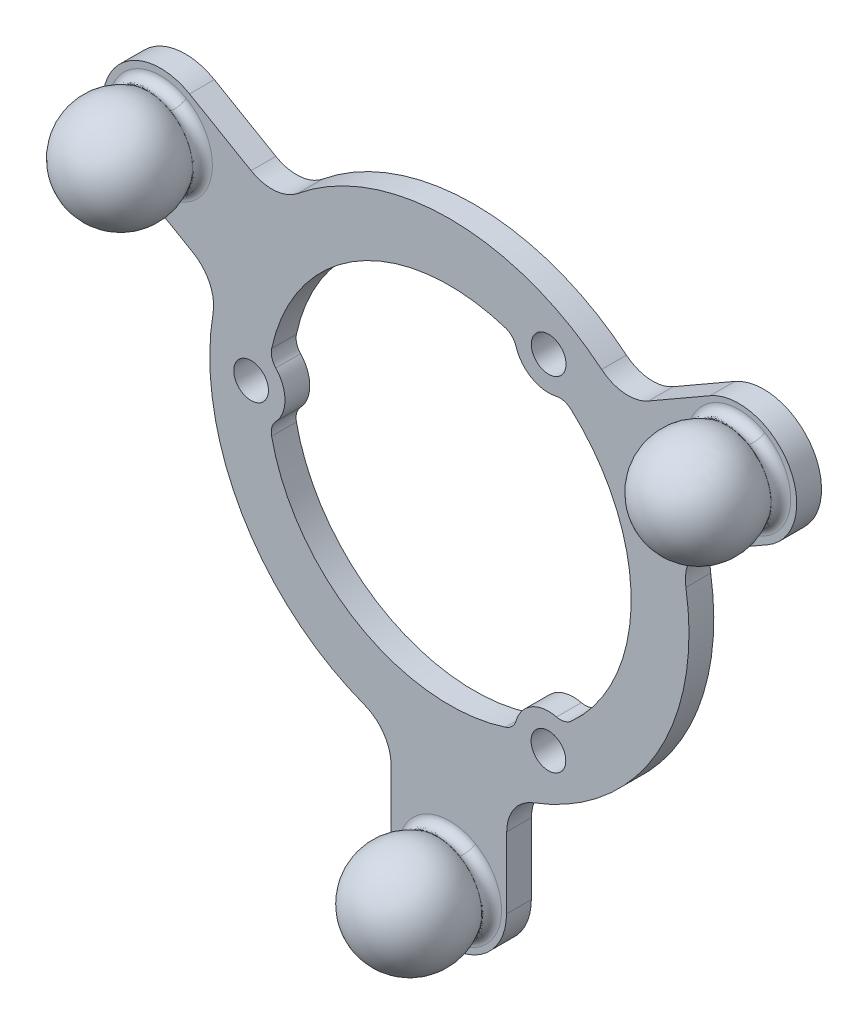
ISO-10303-21;
HEADER;
FILE_DESCRIPTION(('STEP AP214'),'2;1');
FILE_NAME('part.step','',(''),(''),'','','');
FILE_SCHEMA(('AUTOMOTIVE_DESIGN { 1 0 10303 214 1 1 1 1 }'));
ENDSEC;
DATA;
#1=APPLICATION_CONTEXT('core data for automotive mechanical design processes');
#2=APPLICATION_PROTOCOL_DEFINITION('international standard','automotive_design',2000,#1);
#3=PRODUCT_CONTEXT('',#1,'mechanical');
#4=PRODUCT('Part','Part','',(#3));
#5=PRODUCT_RELATED_PRODUCT_CATEGORY('part','',(#4));
#6=PRODUCT_DEFINITION_FORMATION('','',#4);
#7=PRODUCT_DEFINITION_CONTEXT('part definition',#1,'design');
#8=PRODUCT_DEFINITION('design','',#6,#7);
#9=PRODUCT_DEFINITION_SHAPE('','',#8);
#10=(LENGTH_UNIT() NAMED_UNIT(*) SI_UNIT(.MILLI.,.METRE.));
#11=(NAMED_UNIT(*) PLANE_ANGLE_UNIT() SI_UNIT($,.RADIAN.));
#12=(NAMED_UNIT(*) SI_UNIT($,.STERADIAN.) SOLID_ANGLE_UNIT());
#13=UNCERTAINTY_MEASURE_WITH_UNIT(LENGTH_MEASURE(1.E-05),#10,'distance_accuracy_value','');
#14=(GEOMETRIC_REPRESENTATION_CONTEXT(3) GLOBAL_UNCERTAINTY_ASSIGNED_CONTEXT((#13)) GLOBAL_UNIT_ASSIGNED_CONTEXT((#10,
#11,#12)) REPRESENTATION_CONTEXT('',''));
#15=CARTESIAN_POINT('',(0.,0.,0.));
#16=DIRECTION('',(0.,0.,1.));
#17=DIRECTION('',(1.,0.,0.));
#18=AXIS2_PLACEMENT_3D('',#15,#16,#17);
#19=CARTESIAN_POINT('',(-14.3110282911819,25.6556344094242,142.724527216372));
#20=DIRECTION('',(0.,0.,1.));
#21=DIRECTION('',(-0.498030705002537,-0.867159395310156,0.));
#22=AXIS2_PLACEMENT_3D('',#19,#20,#21);
#23=PLANE('',#22);
#24=CARTESIAN_POINT('',(-14.3110282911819,25.6556344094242,142.724527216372));
#25=CARTESIAN_POINT('',(-14.9942148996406,26.0504127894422,142.724527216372));
#26=CARTESIAN_POINT('',(-16.5723355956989,26.5994346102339,142.724527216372));
#27=CARTESIAN_POINT('',(-19.1139205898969,26.4525322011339,142.724527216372));
#28=CARTESIAN_POINT('',(-21.3886335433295,25.3089537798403,142.724527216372));
#29=CARTESIAN_POINT('',(-23.0055566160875,23.436349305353,142.724527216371));
#30=CARTESIAN_POINT('',(-23.818868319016,21.0996607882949,142.724527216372));
#31=CARTESIAN_POINT('',(-23.6718081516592,18.558046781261,142.724527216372));
#32=CARTESIAN_POINT('',(-22.524008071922,16.2746110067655,142.724527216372));
#33=CARTESIAN_POINT('',(-21.2490107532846,15.1787873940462,142.724527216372));
#34=CARTESIAN_POINT('',(-20.5556373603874,14.7826674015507,142.724527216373));
#35=B_SPLINE_CURVE_WITH_KNOTS('',3,(#24,#25,#26,#27,#28,#29,#30,#31,#32,#33,#34),.UNSPECIFIED.,
.F.,.F.,(4,1,1,1,1,1,1,1,4),(0.,2.36732963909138,4.92383302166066,7.48033640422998,
9.84766604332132,12.2149956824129,14.7714990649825,17.328002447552,19.7238240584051),.UNSPECIFIED.);
#36=CARTESIAN_POINT('',(-20.5556373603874,14.7826674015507,142.724527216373));
#37=VERTEX_POINT('',#36);
#38=CARTESIAN_POINT('',(-14.311028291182,25.6556344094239,142.724527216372));
#39=VERTEX_POINT('',#38);
#40=EDGE_CURVE('P0_E46',#37,#39,#35,.F.);
#41=ORIENTED_EDGE('',*,*,#40,.T.);
#42=CARTESIAN_POINT('',(-20.5556373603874,14.7826674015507,142.724527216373));
#43=CARTESIAN_POINT('',(-19.8607482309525,14.3856814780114,142.724527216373));
#44=CARTESIAN_POINT('',(-18.2663970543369,13.8436460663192,142.724527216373));
#45=CARTESIAN_POINT('',(-15.7146991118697,14.0172586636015,142.724527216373));
#46=CARTESIAN_POINT('',(-13.4535012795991,15.182864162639,142.724527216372));
#47=CARTESIAN_POINT('',(-11.8550464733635,17.0700130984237,142.724527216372));
#48=CARTESIAN_POINT('',(-11.0636998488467,19.4152437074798,142.724527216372));
#49=CARTESIAN_POINT('',(-11.2365598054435,21.9572583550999,142.724527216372));
#50=CARTESIAN_POINT('',(-12.3933678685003,24.2011617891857,142.724527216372));
#51=CARTESIAN_POINT('',(-13.6455523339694,25.2716761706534,142.724527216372));
#52=CARTESIAN_POINT('',(-14.3110282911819,25.6556344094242,142.724527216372));
#53=B_SPLINE_CURVE_WITH_KNOTS('',3,(#42,#43,#44,#45,#46,#47,#48,#49,#50,#51,#52),.UNSPECIFIED.,
.F.,.F.,(4,1,1,1,1,1,1,1,4),(19.7238240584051,22.1248830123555,24.6839370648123,
27.2378897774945,29.5999820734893,31.972549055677,34.5316031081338,37.0855558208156,
39.3906642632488),.UNSPECIFIED.);
#54=EDGE_CURVE('P0_E52',#39,#37,#53,.F.);
#55=ORIENTED_EDGE('',*,*,#54,.T.);
#56=EDGE_LOOP('',(#41,#55));
#57=FACE_BOUND('',#56,.T.);
#58=ADVANCED_FACE('P0_F16',(#57),#23,.F.);
#59=CARTESIAN_POINT('',(-14.7375074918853,24.9169507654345,144.246506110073));
#60=DIRECTION('',(0.,0.,1.));
#61=DIRECTION('',(-0.498030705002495,-0.86715939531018,0.));
#62=AXIS2_PLACEMENT_3D('',#59,#60,#61);
#63=PLANE('',#62);
#64=CARTESIAN_POINT('',(-14.7375074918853,24.9169507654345,144.246506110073));
#65=CARTESIAN_POINT('',(-15.3277435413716,25.2580178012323,144.246506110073));
#66=CARTESIAN_POINT('',(-16.6911539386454,25.7323427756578,144.246506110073));
#67=CARTESIAN_POINT('',(-18.886945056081,25.6054270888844,144.246506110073));
#68=CARTESIAN_POINT('',(-20.8521732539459,24.617437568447,144.246506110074));
#69=CARTESIAN_POINT('',(-22.2491067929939,22.9996092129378,144.246506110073));
#70=CARTESIAN_POINT('',(-22.9517638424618,20.9808375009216,144.246506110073));
#71=CARTESIAN_POINT('',(-22.8247118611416,18.7850213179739,144.246506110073));
#72=CARTESIAN_POINT('',(-21.8330750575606,16.8122570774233,144.246506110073));
#73=CARTESIAN_POINT('',(-20.7315467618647,15.865525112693,144.246506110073));
#74=CARTESIAN_POINT('',(-20.1325098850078,15.5232989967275,144.246506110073));
#75=B_SPLINE_CURVE_WITH_KNOTS('',3,(#64,#65,#66,#67,#68,#69,#70,#71,#72,#73,#74),.UNSPECIFIED.,
.F.,.F.,(4,1,1,1,1,1,1,1,4),(0.,2.36732963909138,4.92383302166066,7.48033640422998,
9.84766604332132,12.2149956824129,14.7714990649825,17.328002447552,19.7238240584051),.UNSPECIFIED.);
#76=CARTESIAN_POINT('',(-14.7375074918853,24.9169507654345,144.246506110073));
#77=VERTEX_POINT('',#76);
#78=CARTESIAN_POINT('',(-20.1325098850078,15.5232989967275,144.246506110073));
#79=VERTEX_POINT('',#78);
#80=EDGE_CURVE('P0_E11',#77,#79,#75,.T.);
#81=ORIENTED_EDGE('',*,*,#80,.T.);
#82=CARTESIAN_POINT('',(-20.1325098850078,15.5232989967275,144.246506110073));
#83=CARTESIAN_POINT('',(-19.5321634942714,15.1803247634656,144.246506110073));
#84=CARTESIAN_POINT('',(-18.1547308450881,14.7120356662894,144.246506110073));
#85=CARTESIAN_POINT('',(-15.9502026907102,14.8620275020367,144.246506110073));
#86=CARTESIAN_POINT('',(-13.996650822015,15.8690472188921,144.246506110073));
#87=CARTESIAN_POINT('',(-12.6156728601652,17.4994411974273,144.246506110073));
#88=CARTESIAN_POINT('',(-11.9319924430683,19.525592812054,144.246506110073));
#89=CARTESIAN_POINT('',(-12.0813340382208,21.7217551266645,144.246506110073));
#90=CARTESIAN_POINT('',(-13.0807532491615,23.6603655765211,144.246506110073));
#91=CARTESIAN_POINT('',(-14.1625724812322,24.585231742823,144.246506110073));
#92=CARTESIAN_POINT('',(-14.7375074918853,24.9169507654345,144.246506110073));
#93=B_SPLINE_CURVE_WITH_KNOTS('',3,(#82,#83,#84,#85,#86,#87,#88,#89,#90,#91,#92),.UNSPECIFIED.,
.F.,.F.,(4,1,1,1,1,1,1,1,4),(19.7238240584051,22.1248830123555,24.6839370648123,
27.2378897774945,29.5999820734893,31.972549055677,34.5316031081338,37.0855558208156,
39.3906642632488),.UNSPECIFIED.);
#94=EDGE_CURVE('P0_E20',#79,#77,#93,.T.);
#95=ORIENTED_EDGE('',*,*,#94,.T.);
#96=EDGE_LOOP('',(#81,#95));
#97=FACE_BOUND('',#96,.T.);
#98=ADVANCED_FACE('P0_F18',(#97),#63,.T.);
#99=CARTESIAN_POINT('',(-20.1325098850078,15.5232989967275,144.246506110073));
#100=CARTESIAN_POINT('',(-19.9807965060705,15.7888542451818,143.746753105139));
#101=CARTESIAN_POINT('',(-20.1228917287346,15.540134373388,143.235640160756));
#102=CARTESIAN_POINT('',(-20.2649869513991,15.2914145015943,142.724527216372));
#103=CARTESIAN_POINT('',(-20.5556373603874,14.7826674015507,142.724527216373));
#104=CARTESIAN_POINT('',(-19.5321634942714,15.1803247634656,144.246506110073));
#105=CARTESIAN_POINT('',(-19.4143486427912,15.4652460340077,143.746753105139));
#106=CARTESIAN_POINT('',(-19.5246943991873,15.1983878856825,143.235640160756));
#107=CARTESIAN_POINT('',(-19.6350401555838,14.9315297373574,142.724527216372));
#108=CARTESIAN_POINT('',(-19.8607482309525,14.3856814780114,142.724527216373));
#109=CARTESIAN_POINT('',(-18.1547308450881,14.7120356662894,144.246506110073));
#110=CARTESIAN_POINT('',(-18.1146926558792,15.0233988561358,143.746753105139));
#111=CARTESIAN_POINT('',(-18.1521925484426,14.7317751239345,143.235640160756));
#112=CARTESIAN_POINT('',(-18.1896924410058,14.4401513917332,142.724527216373));
#113=CARTESIAN_POINT('',(-18.2663970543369,13.8436460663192,142.724527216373));
#114=CARTESIAN_POINT('',(-15.9502026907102,14.8620275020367,144.246506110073));
#115=CARTESIAN_POINT('',(-16.0346430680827,15.1649214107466,143.746753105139));
#116=CARTESIAN_POINT('',(-15.9555559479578,14.881230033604,143.235640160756));
#117=CARTESIAN_POINT('',(-15.8764688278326,14.5975386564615,142.724527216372));
#118=CARTESIAN_POINT('',(-15.7146991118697,14.0172586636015,142.724527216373));
#119=CARTESIAN_POINT('',(-13.996650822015,15.8690472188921,144.246506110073));
#120=CARTESIAN_POINT('',(-14.1913984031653,16.1150798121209,143.746753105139));
#121=CARTESIAN_POINT('',(-14.0089972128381,15.8846449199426,143.235640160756));
#122=CARTESIAN_POINT('',(-13.82659602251,15.6542100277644,142.724527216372));
#123=CARTESIAN_POINT('',(-13.4535012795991,15.182864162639,142.724527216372));
#124=CARTESIAN_POINT('',(-12.6156728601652,17.4994411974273,144.246506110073));
#125=CARTESIAN_POINT('',(-12.8883972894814,17.6534136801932,143.746753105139));
#126=CARTESIAN_POINT('',(-12.6329627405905,17.5092025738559,143.235640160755));
#127=CARTESIAN_POINT('',(-12.3775281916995,17.3649914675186,142.724527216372));
#128=CARTESIAN_POINT('',(-11.8550464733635,17.0700130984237,142.724527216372));
#129=CARTESIAN_POINT('',(-11.9319924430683,19.525592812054,144.246506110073));
#130=CARTESIAN_POINT('',(-12.2433208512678,19.5651587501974,143.746753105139));
#131=CARTESIAN_POINT('',(-11.9517296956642,19.5281011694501,143.235640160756));
#132=CARTESIAN_POINT('',(-11.6601385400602,19.4910435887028,142.724527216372));
#133=CARTESIAN_POINT('',(-11.0636998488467,19.4152437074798,142.724527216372));
#134=CARTESIAN_POINT('',(-12.0813340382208,21.7217551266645,144.246506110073));
#135=CARTESIAN_POINT('',(-12.3842298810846,21.6373148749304,143.746753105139));
#136=CARTESIAN_POINT('',(-12.1005366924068,21.716401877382,143.235640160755));
#137=CARTESIAN_POINT('',(-11.8168435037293,21.7954888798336,142.724527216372));
#138=CARTESIAN_POINT('',(-11.2365598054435,21.9572583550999,142.724527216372));
#139=CARTESIAN_POINT('',(-13.0807532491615,23.6603655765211,144.246506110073));
#140=CARTESIAN_POINT('',(-13.3272169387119,23.4664617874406,143.746753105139));
#141=CARTESIAN_POINT('',(-13.0963782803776,23.6480726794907,143.235640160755));
#142=CARTESIAN_POINT('',(-12.8655396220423,23.8296835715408,142.724527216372));
#143=CARTESIAN_POINT('',(-12.3933678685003,24.2011617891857,142.724527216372));
#144=CARTESIAN_POINT('',(-14.1625724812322,24.585231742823,144.246506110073));
#145=CARTESIAN_POINT('',(-14.3479513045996,24.3391054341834,143.746753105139));
#146=CARTESIAN_POINT('',(-14.174324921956,24.5696281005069,143.235640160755));
#147=CARTESIAN_POINT('',(-14.0006985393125,24.8001507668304,142.724527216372));
#148=CARTESIAN_POINT('',(-13.6455523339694,25.2716761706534,142.724527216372));
#149=CARTESIAN_POINT('',(-14.7375074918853,24.9169507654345,144.246506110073));
#150=CARTESIAN_POINT('',(-14.8904226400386,24.6520939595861,143.746753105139));
#151=CARTESIAN_POINT('',(-14.7472018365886,24.9001596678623,143.235640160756));
#152=CARTESIAN_POINT('',(-14.6039810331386,25.1482253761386,142.724527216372));
#153=CARTESIAN_POINT('',(-14.3110282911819,25.6556344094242,142.724527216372));
#154=(BOUNDED_SURFACE() B_SPLINE_SURFACE(3,2,((#99,#100,#101,#102,#103),(#104,#105,#106,#107,
#108),(#109,#110,#111,#112,#113),(#114,#115,#116,#117,#118),(#119,#120,#121,#122,#123),(#124,
#125,#126,#127,#128),(#129,#130,#131,#132,#133),(#134,#135,#136,#137,#138),(#139,#140,#141,#142,
#143),(#144,#145,#146,#147,#148),(#149,#150,#151,#152,#153)),.UNSPECIFIED.,.F.,.F.,
.F.) B_SPLINE_SURFACE_WITH_KNOTS((4,1,1,1,1,1,1,1,4),(3,2,3),(19.7238240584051,22.1248830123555,
24.6839370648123,27.2378897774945,29.5999820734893,31.972549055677,34.5316031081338,
37.0855558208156,39.3906642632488),(0.,0.5,1.),
.UNSPECIFIED.) GEOMETRIC_REPRESENTATION_ITEM() RATIONAL_B_SPLINE_SURFACE(((1.,0.862811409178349,
1.00000000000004,0.862811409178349,1.),(1.,0.86281140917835,1.00000000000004,0.86281140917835,
1.),(1.,0.862811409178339,1.00000000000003,0.862811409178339,1.),(1.,0.862811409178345,
1.00000000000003,0.862811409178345,1.),(1.,0.862811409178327,1.00000000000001,0.862811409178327,
1.),(1.,0.862811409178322,1.00000000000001,0.862811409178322,1.),(1.,0.862811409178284,
0.999999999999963,0.862811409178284,1.),(1.,0.862811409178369,1.00000000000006,
0.862811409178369,1.),(1.,0.862811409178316,1.,0.862811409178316,1.),(1.,0.862811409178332,
1.00000000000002,0.862811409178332,1.),(1.,0.862811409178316,1.,0.862811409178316,1.))) REPRESENTATION_ITEM('') SURFACE());
#155=CARTESIAN_POINT('',(-14.3110282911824,25.6556344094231,143.724527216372));
#156=DIRECTION('',(-0.866025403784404,0.50000000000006,0.));
#157=DIRECTION('',(-0.50000000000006,-0.866025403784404,0.));
#158=AXIS2_PLACEMENT_3D('',#155,#156,#157);
#159=CIRCLE('',#158,0.999999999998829);
#160=EDGE_CURVE('P0_E28',#39,#77,#159,.T.);
#161=CARTESIAN_POINT('',(-20.1325098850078,15.5232989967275,144.246506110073));
#162=CARTESIAN_POINT('',(-19.9807965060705,15.7888542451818,143.746753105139));
#163=CARTESIAN_POINT('',(-20.1228917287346,15.540134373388,143.235640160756));
#164=CARTESIAN_POINT('',(-20.2649869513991,15.2914145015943,142.724527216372));
#165=CARTESIAN_POINT('',(-20.5556373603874,14.7826674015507,142.724527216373));
#166=(BOUNDED_CURVE() B_SPLINE_CURVE(2,(#161,#162,#163,#164,#165),.UNSPECIFIED.,.F.,
.F.) B_SPLINE_CURVE_WITH_KNOTS((3,2,3),(0.,0.5,1.),
.UNSPECIFIED.) CURVE() GEOMETRIC_REPRESENTATION_ITEM() RATIONAL_B_SPLINE_CURVE((1.,
0.862811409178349,1.00000000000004,0.862811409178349,1.)) REPRESENTATION_ITEM(''));
#167=EDGE_CURVE('P0_E49',#79,#37,#166,.T.);
#168=ORIENTED_EDGE('',*,*,#54,.F.);
#169=ORIENTED_EDGE('',*,*,#160,.T.);
#170=ORIENTED_EDGE('',*,*,#94,.F.);
#171=ORIENTED_EDGE('',*,*,#167,.T.);
#172=EDGE_LOOP('',(#168,#169,#170,#171));
#173=FACE_BOUND('',#172,.T.);
#174=ADVANCED_FACE('P0_F53',(#173),#154,.F.);
#175=CARTESIAN_POINT('',(-14.7375074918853,24.9169507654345,144.246506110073));
#176=CARTESIAN_POINT('',(-14.8904226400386,24.6520939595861,143.746753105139));
#177=CARTESIAN_POINT('',(-14.7472018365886,24.9001596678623,143.235640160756));
#178=CARTESIAN_POINT('',(-14.6039810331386,25.1482253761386,142.724527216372));
#179=CARTESIAN_POINT('',(-14.3110282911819,25.6556344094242,142.724527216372));
#180=CARTESIAN_POINT('',(-15.3277435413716,25.2580178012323,144.246506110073));
#181=CARTESIAN_POINT('',(-15.4473310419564,24.973902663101,143.746753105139));
#182=CARTESIAN_POINT('',(-15.3353250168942,25.2400057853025,143.235640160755));
#183=CARTESIAN_POINT('',(-15.2233189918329,25.5061089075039,142.724527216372));
#184=CARTESIAN_POINT('',(-14.9942148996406,26.0504127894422,142.724527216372));
#185=CARTESIAN_POINT('',(-16.6911539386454,25.7323427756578,144.246506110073));
#186=CARTESIAN_POINT('',(-16.7337565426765,25.4214449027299,143.746753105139));
#187=CARTESIAN_POINT('',(-16.6938548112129,25.7126328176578,143.235640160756));
#188=CARTESIAN_POINT('',(-16.6539530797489,26.0038207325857,142.724527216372));
#189=CARTESIAN_POINT('',(-16.5723355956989,26.5994346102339,142.724527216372));
#190=CARTESIAN_POINT('',(-18.886945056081,25.6054270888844,144.246506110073));
#191=CARTESIAN_POINT('',(-18.8055624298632,25.3016955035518,143.746753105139));
#192=CARTESIAN_POINT('',(-18.8817856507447,25.586171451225,143.235640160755));
#193=CARTESIAN_POINT('',(-18.9580088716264,25.870647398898,142.724527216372));
#194=CARTESIAN_POINT('',(-19.1139205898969,26.4525322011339,142.724527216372));
#195=CARTESIAN_POINT('',(-20.8521732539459,24.617437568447,144.246506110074));
#196=CARTESIAN_POINT('',(-20.6598241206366,24.3694927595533,143.746753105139));
#197=CARTESIAN_POINT('',(-20.8399789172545,24.6017186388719,143.235640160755));
#198=CARTESIAN_POINT('',(-21.0201337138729,24.8339445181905,142.724527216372));
#199=CARTESIAN_POINT('',(-21.3886335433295,25.3089537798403,142.724527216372));
#200=CARTESIAN_POINT('',(-22.2491067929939,22.9996092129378,144.246506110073));
#201=CARTESIAN_POINT('',(-21.9778798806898,22.8430149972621,143.746753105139));
#202=CARTESIAN_POINT('',(-22.231911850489,22.9896816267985,143.235640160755));
#203=CARTESIAN_POINT('',(-22.4859438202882,23.1363482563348,142.724527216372));
#204=CARTESIAN_POINT('',(-23.0055566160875,23.436349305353,142.724527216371));
#205=CARTESIAN_POINT('',(-22.9517638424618,20.9808375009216,144.246506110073));
#206=CARTESIAN_POINT('',(-22.6408614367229,20.9382331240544,143.746753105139));
#207=CARTESIAN_POINT('',(-22.9320535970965,20.9781365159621,143.235640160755));
#208=CARTESIAN_POINT('',(-23.2232457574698,21.0180399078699,142.724527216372));
#209=CARTESIAN_POINT('',(-23.818868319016,21.0996607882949,142.724527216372));
#210=CARTESIAN_POINT('',(-22.8247118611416,18.7850213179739,144.246506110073));
#211=CARTESIAN_POINT('',(-22.5209834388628,18.8664035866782,143.746753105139));
#212=CARTESIAN_POINT('',(-22.8054564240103,18.7901807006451,143.235640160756));
#213=CARTESIAN_POINT('',(-23.0899294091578,18.713957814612,142.724527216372));
#214=CARTESIAN_POINT('',(-23.6718081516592,18.558046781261,142.724527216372));
#215=CARTESIAN_POINT('',(-21.8330750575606,16.8122570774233,144.246506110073));
#216=CARTESIAN_POINT('',(-21.5853393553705,17.0050313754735,143.746753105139));
#217=CARTESIAN_POINT('',(-21.8173693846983,16.8244783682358,143.235640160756));
#218=CARTESIAN_POINT('',(-22.0493994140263,16.643925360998,142.724527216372));
#219=CARTESIAN_POINT('',(-22.524008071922,16.2746110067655,142.724527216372));
#220=CARTESIAN_POINT('',(-20.7315467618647,15.865525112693,144.246506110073));
#221=CARTESIAN_POINT('',(-20.5460087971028,16.1117565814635,143.746753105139));
#222=CARTESIAN_POINT('',(-20.7197842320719,15.8811354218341,143.235640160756));
#223=CARTESIAN_POINT('',(-20.8935596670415,15.6505142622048,142.724527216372));
#224=CARTESIAN_POINT('',(-21.2490107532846,15.1787873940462,142.724527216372));
#225=CARTESIAN_POINT('',(-20.1325098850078,15.5232989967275,144.246506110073));
#226=CARTESIAN_POINT('',(-19.9807965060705,15.7888542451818,143.746753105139));
#227=CARTESIAN_POINT('',(-20.1228917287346,15.540134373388,143.235640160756));
#228=CARTESIAN_POINT('',(-20.2649869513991,15.2914145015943,142.724527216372));
#229=CARTESIAN_POINT('',(-20.5556373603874,14.7826674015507,142.724527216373));
#230=(BOUNDED_SURFACE() B_SPLINE_SURFACE(3,2,((#175,#176,#177,#178,#179),(#180,#181,#182,#183,
#184),(#185,#186,#187,#188,#189),(#190,#191,#192,#193,#194),(#195,#196,#197,#198,#199),(#200,
#201,#202,#203,#204),(#205,#206,#207,#208,#209),(#210,#211,#212,#213,#214),(#215,#216,#217,#218,
#219),(#220,#221,#222,#223,#224),(#225,#226,#227,#228,#229)),.UNSPECIFIED.,.F.,.F.,
.F.) B_SPLINE_SURFACE_WITH_KNOTS((4,1,1,1,1,1,1,1,4),(3,2,3),(0.,2.36732963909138,
4.92383302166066,7.48033640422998,9.84766604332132,12.2149956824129,14.7714990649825,
17.328002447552,19.7238240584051),(0.,0.5,1.),
.UNSPECIFIED.) GEOMETRIC_REPRESENTATION_ITEM() RATIONAL_B_SPLINE_SURFACE(((1.,0.862811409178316,
1.,0.862811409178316,1.),(0.999999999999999,0.862811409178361,1.00000000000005,
0.862811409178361,0.999999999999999),(0.999999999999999,0.862811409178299,0.99999999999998,
0.862811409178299,0.999999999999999),(1.,0.862811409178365,1.00000000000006,0.862811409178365,
1.),(0.999999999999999,0.862811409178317,1.,0.862811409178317,0.999999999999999),(1.,
0.862811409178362,1.00000000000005,0.862811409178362,1.),(1.,0.862811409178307,
0.999999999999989,0.862811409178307,1.),(1.,0.862811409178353,1.00000000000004,
0.862811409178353,1.),(1.,0.862811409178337,1.00000000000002,0.862811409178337,1.),(1.,
0.862811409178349,1.00000000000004,0.862811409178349,1.),(1.,0.862811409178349,1.00000000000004,
0.862811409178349,1.))) REPRESENTATION_ITEM('') SURFACE());
#231=ORIENTED_EDGE('',*,*,#160,.F.);
#232=ORIENTED_EDGE('',*,*,#40,.F.);
#233=ORIENTED_EDGE('',*,*,#167,.F.);
#234=ORIENTED_EDGE('',*,*,#80,.F.);
#235=EDGE_LOOP('',(#231,#232,#233,#234));
#236=FACE_BOUND('',#235,.T.);
#237=ADVANCED_FACE('P0_F48',(#236),#230,.F.);
#238=CLOSED_SHELL('',(#58,#98,#174,#237));
#239=MANIFOLD_SOLID_BREP('P0_B1',#238);
#240=CARTESIAN_POINT('',(14.4443608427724,-45.8391107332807,142.724527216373));
#241=DIRECTION('',(0.,0.,-1.));
#242=DIRECTION('',(0.498030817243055,0.867159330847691,0.));
#243=AXIS2_PLACEMENT_3D('',#240,#241,#242);
#244=PLANE('',#243);
#245=CARTESIAN_POINT('',(14.4443608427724,-45.8391107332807,142.724527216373));
#246=CARTESIAN_POINT('',(13.7509930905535,-45.4429813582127,142.724527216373));
#247=CARTESIAN_POINT('',(12.4760211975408,-44.3471420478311,142.724527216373));
#248=CARTESIAN_POINT('',(11.3281559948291,-42.0637183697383,142.724527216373));
#249=CARTESIAN_POINT('',(11.1811529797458,-39.5221278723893,142.724527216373));
#250=CARTESIAN_POINT('',(11.9944320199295,-37.1854231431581,142.724527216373));
#251=CARTESIAN_POINT('',(13.6113730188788,-35.3128278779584,142.724527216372));
#252=CARTESIAN_POINT('',(15.8860753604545,-34.169243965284,142.724527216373));
#253=CARTESIAN_POINT('',(18.4276673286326,-34.0223451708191,142.724527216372));
#254=CARTESIAN_POINT('',(20.0057836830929,-34.5713647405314,142.724527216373));
#255=CARTESIAN_POINT('',(20.6889717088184,-34.9661438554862,142.724527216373));
#256=B_SPLINE_CURVE_WITH_KNOTS('',3,(#245,#246,#247,#248,#249,#250,#251,#252,#253,#254,#255),
.UNSPECIFIED.,.F.,.F.,(4,1,1,1,1,1,1,1,4),(19.6668402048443,22.0626618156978,24.6191651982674,
27.1756685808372,29.5429982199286,31.9103278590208,34.4668312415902,37.0233346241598,
39.3906642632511),.UNSPECIFIED.);
#257=CARTESIAN_POINT('',(14.4443608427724,-45.8391107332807,142.724527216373));
#258=VERTEX_POINT('',#257);
#259=CARTESIAN_POINT('',(20.6889717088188,-34.9661438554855,142.724527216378));
#260=VERTEX_POINT('',#259);
#261=EDGE_CURVE('P1_E44',#258,#260,#256,.T.);
#262=ORIENTED_EDGE('',*,*,#261,.T.);
#263=CARTESIAN_POINT('',(20.6889717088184,-34.9661438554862,142.724527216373));
#264=CARTESIAN_POINT('',(21.3544463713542,-35.3501014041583,142.724527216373));
#265=CARTESIAN_POINT('',(22.6066348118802,-36.4206179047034,142.724527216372));
#266=CARTESIAN_POINT('',(23.7634364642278,-38.6645179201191,142.724527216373));
#267=CARTESIAN_POINT('',(23.9363061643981,-41.2065377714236,142.724527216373));
#268=CARTESIAN_POINT('',(23.1449431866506,-43.5517595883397,142.724527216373));
#269=CARTESIAN_POINT('',(21.546517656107,-45.4389247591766,142.724527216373));
#270=CARTESIAN_POINT('',(19.2852724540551,-46.6044996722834,142.724527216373));
#271=CARTESIAN_POINT('',(16.7335976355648,-46.7781646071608,142.724527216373));
#272=CARTESIAN_POINT('',(15.1392443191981,-46.2361060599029,142.724527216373));
#273=CARTESIAN_POINT('',(14.4443608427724,-45.8391107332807,142.724527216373));
#274=B_SPLINE_CURVE_WITH_KNOTS('',3,(#263,#264,#265,#266,#267,#268,#269,#270,#271,#272,#273),
.UNSPECIFIED.,.F.,.F.,(4,1,1,1,1,1,1,1,4),(0.,2.30510844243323,4.85906115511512,
7.41811520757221,9.79068218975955,12.1527744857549,14.7067271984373,17.265781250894,
19.6668402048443),.UNSPECIFIED.);
#275=EDGE_CURVE('P1_E47',#260,#258,#274,.T.);
#276=ORIENTED_EDGE('',*,*,#275,.T.);
#277=EDGE_LOOP('',(#262,#276));
#278=FACE_BOUND('',#277,.T.);
#279=ADVANCED_FACE('P1_F16',(#278),#244,.T.);
#280=CARTESIAN_POINT('',(14.86748856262,-45.0984791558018,144.246506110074));
#281=DIRECTION('',(0.,0.,-1.));
#282=DIRECTION('',(0.498030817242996,0.867159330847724,0.));
#283=AXIS2_PLACEMENT_3D('',#280,#281,#282);
#284=PLANE('',#283);
#285=CARTESIAN_POINT('',(14.86748856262,-45.0984791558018,144.246506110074));
#286=CARTESIAN_POINT('',(14.2684565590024,-44.7562449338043,144.246506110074));
#287=CARTESIAN_POINT('',(13.1669502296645,-43.8094994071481,144.246506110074));
#288=CARTESIAN_POINT('',(12.1752571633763,-41.8367456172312,144.246506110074));
#289=CARTESIAN_POINT('',(12.0482545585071,-39.6409497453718,144.246506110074));
#290=CARTESIAN_POINT('',(12.7508833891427,-37.6221640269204,144.246506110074));
#291=CARTESIAN_POINT('',(14.1478324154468,-36.0043436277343,144.246506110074));
#292=CARTESIAN_POINT('',(16.1130514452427,-35.0163493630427,144.246506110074));
#293=CARTESIAN_POINT('',(18.3088485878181,-34.8894367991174,144.246506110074));
#294=CARTESIAN_POINT('',(19.6722552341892,-35.3637598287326,144.246506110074));
#295=CARTESIAN_POINT('',(20.2624925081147,-35.7048274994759,144.246506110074));
#296=B_SPLINE_CURVE_WITH_KNOTS('',3,(#285,#286,#287,#288,#289,#290,#291,#292,#293,#294,#295),
.UNSPECIFIED.,.F.,.F.,(4,1,1,1,1,1,1,1,4),(19.6668402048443,22.0626618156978,24.6191651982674,
27.1756685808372,29.5429982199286,31.9103278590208,34.4668312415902,37.0233346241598,
39.3906642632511),.UNSPECIFIED.);
#297=CARTESIAN_POINT('',(20.2624925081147,-35.7048274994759,144.246506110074));
#298=VERTEX_POINT('',#297);
#299=CARTESIAN_POINT('',(14.86748856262,-45.0984791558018,144.246506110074));
#300=VERTEX_POINT('',#299);
#301=EDGE_CURVE('P1_E28',#298,#300,#296,.F.);
#302=ORIENTED_EDGE('',*,*,#301,.T.);
#303=CARTESIAN_POINT('',(20.2624925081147,-35.7048274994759,144.246506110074));
#304=CARTESIAN_POINT('',(20.8374264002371,-36.0365459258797,144.246506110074));
#305=CARTESIAN_POINT('',(21.9192490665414,-36.9614139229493,144.246506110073));
#306=CARTESIAN_POINT('',(22.9186627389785,-38.9000214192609,144.246506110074));
#307=CARTESIAN_POINT('',(23.0680127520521,-41.0961882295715,144.246506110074));
#308=CARTESIAN_POINT('',(22.3843182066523,-43.1223322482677,144.246506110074));
#309=CARTESIAN_POINT('',(21.0033655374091,-44.7527402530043,144.246506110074));
#310=CARTESIAN_POINT('',(19.0497727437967,-45.7597335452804,144.246506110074));
#311=CARTESIAN_POINT('',(16.8452645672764,-45.9097705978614,144.246506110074));
#312=CARTESIAN_POINT('',(15.4678300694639,-45.4414615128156,144.246506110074));
#313=CARTESIAN_POINT('',(14.86748856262,-45.0984791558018,144.246506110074));
#314=B_SPLINE_CURVE_WITH_KNOTS('',3,(#303,#304,#305,#306,#307,#308,#309,#310,#311,#312,#313),
.UNSPECIFIED.,.F.,.F.,(4,1,1,1,1,1,1,1,4),(0.,2.30510844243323,4.85906115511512,
7.41811520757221,9.79068218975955,12.1527744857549,14.7067271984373,17.265781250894,
19.6668402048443),.UNSPECIFIED.);
#315=EDGE_CURVE('P1_E20',#300,#298,#314,.F.);
#316=ORIENTED_EDGE('',*,*,#315,.T.);
#317=EDGE_LOOP('',(#302,#316));
#318=FACE_BOUND('',#317,.T.);
#319=ADVANCED_FACE('P1_F18',(#318),#284,.F.);
#320=CARTESIAN_POINT('',(20.6889717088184,-34.9661438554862,142.724527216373));
#321=CARTESIAN_POINT('',(20.3960189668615,-35.4735528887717,142.724527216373));
#322=CARTESIAN_POINT('',(20.2527981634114,-35.7216185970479,143.235640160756));
#323=CARTESIAN_POINT('',(20.1095773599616,-35.9696843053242,143.74675310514));
#324=CARTESIAN_POINT('',(20.2624925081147,-35.7048274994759,144.246506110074));
#325=CARTESIAN_POINT('',(21.3544463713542,-35.3501014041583,142.724527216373));
#326=CARTESIAN_POINT('',(20.9993002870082,-35.8216268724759,142.724527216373));
#327=CARTESIAN_POINT('',(20.8256739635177,-36.05214957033,143.235640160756));
#328=CARTESIAN_POINT('',(20.6520476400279,-36.282672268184,143.746753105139));
#329=CARTESIAN_POINT('',(20.8374264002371,-36.0365459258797,144.246506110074));
#330=CARTESIAN_POINT('',(22.6066348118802,-36.4206179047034,142.724527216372));
#331=CARTESIAN_POINT('',(22.1344628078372,-36.7920959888,142.724527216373));
#332=CARTESIAN_POINT('',(21.9036240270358,-36.9737068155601,143.235640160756));
#333=CARTESIAN_POINT('',(21.6727852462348,-37.1553176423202,143.746753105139));
#334=CARTESIAN_POINT('',(21.9192490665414,-36.9614139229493,144.246506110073));
#335=CARTESIAN_POINT('',(23.7634364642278,-38.6645179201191,142.724527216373));
#336=CARTESIAN_POINT('',(23.1831531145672,-38.8262875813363,142.724527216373));
#337=CARTESIAN_POINT('',(22.8994600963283,-38.9053746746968,143.235640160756));
#338=CARTESIAN_POINT('',(22.6157670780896,-38.9844617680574,143.746753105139));
#339=CARTESIAN_POINT('',(22.9186627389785,-38.9000214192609,144.246506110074));
#340=CARTESIAN_POINT('',(23.9363061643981,-41.2065377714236,142.724527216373));
#341=CARTESIAN_POINT('',(23.339866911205,-41.13073758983,142.724527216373));
#342=CARTESIAN_POINT('',(23.0482754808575,-41.0936798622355,143.235640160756));
#343=CARTESIAN_POINT('',(22.7566840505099,-41.056622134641,143.74675310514));
#344=CARTESIAN_POINT('',(23.0680127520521,-41.0961882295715,144.246506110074));
#345=CARTESIAN_POINT('',(23.1449431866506,-43.5517595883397,142.724527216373));
#346=CARTESIAN_POINT('',(22.6224624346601,-43.2567817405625,142.724527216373));
#347=CARTESIAN_POINT('',(22.3670283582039,-43.1125708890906,143.235640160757));
#348=CARTESIAN_POINT('',(22.1115942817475,-42.9683600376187,143.74675310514));
#349=CARTESIAN_POINT('',(22.3843182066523,-43.1223322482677,144.246506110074));
#350=CARTESIAN_POINT('',(21.546517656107,-45.4389247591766,142.724527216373));
#351=CARTESIAN_POINT('',(21.1734211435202,-44.9675778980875,142.724527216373));
#352=CARTESIAN_POINT('',(20.9910190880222,-44.7371425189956,143.235640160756));
#353=CARTESIAN_POINT('',(20.808617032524,-44.5067071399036,143.74675310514));
#354=CARTESIAN_POINT('',(21.0033655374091,-44.7527402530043,144.246506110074));
#355=CARTESIAN_POINT('',(19.2852724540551,-46.6044996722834,142.724527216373));
#356=CARTESIAN_POINT('',(19.1235053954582,-46.0242215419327,142.724527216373));
#357=CARTESIAN_POINT('',(19.0444195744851,-45.7405310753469,143.235640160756));
#358=CARTESIAN_POINT('',(18.9653337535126,-45.456840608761,143.74675310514));
#359=CARTESIAN_POINT('',(19.0497727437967,-45.7597335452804,144.246506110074));
#360=CARTESIAN_POINT('',(16.7335976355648,-46.7781646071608,142.724527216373));
#361=CARTESIAN_POINT('',(16.8103027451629,-46.1816562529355,142.724527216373));
#362=CARTESIAN_POINT('',(16.8478028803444,-45.8900310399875,143.235640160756));
#363=CARTESIAN_POINT('',(16.8853030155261,-45.5984058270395,143.74675310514));
#364=CARTESIAN_POINT('',(16.8452645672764,-45.9097705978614,144.246506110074));
#365=CARTESIAN_POINT('',(15.1392443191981,-46.2361060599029,142.724527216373));
#366=CARTESIAN_POINT('',(15.3649530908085,-45.6902569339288,142.724527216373));
#367=CARTESIAN_POINT('',(15.4752991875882,-45.4233983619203,143.235640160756));
#368=CARTESIAN_POINT('',(15.5856452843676,-45.1565397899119,143.74675310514));
#369=CARTESIAN_POINT('',(15.4678300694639,-45.4414615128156,144.246506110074));
#370=CARTESIAN_POINT('',(14.4443608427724,-45.8391107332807,142.724527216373));
#371=CARTESIAN_POINT('',(14.7350114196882,-45.330363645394,142.724527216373));
#372=CARTESIAN_POINT('',(14.8771067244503,-45.0816437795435,143.235640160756));
#373=CARTESIAN_POINT('',(15.0192020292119,-44.8329239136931,143.74675310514));
#374=CARTESIAN_POINT('',(14.86748856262,-45.0984791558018,144.246506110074));
#375=(BOUNDED_SURFACE() B_SPLINE_SURFACE(3,2,((#320,#321,#322,#323,#324),(#325,#326,#327,#328,
#329),(#330,#331,#332,#333,#334),(#335,#336,#337,#338,#339),(#340,#341,#342,#343,#344),(#345,
#346,#347,#348,#349),(#350,#351,#352,#353,#354),(#355,#356,#357,#358,#359),(#360,#361,#362,#363,
#364),(#365,#366,#367,#368,#369),(#370,#371,#372,#373,#374)),.UNSPECIFIED.,.F.,.F.,
.F.) B_SPLINE_SURFACE_WITH_KNOTS((4,1,1,1,1,1,1,1,4),(3,2,3),(0.,2.30510844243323,
4.85906115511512,7.41811520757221,9.79068218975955,12.1527744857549,14.7067271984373,
17.265781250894,19.6668402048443),(0.,0.5,1.),
.UNSPECIFIED.) GEOMETRIC_REPRESENTATION_ITEM() RATIONAL_B_SPLINE_SURFACE(((1.,0.862811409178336,
1.,0.862811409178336,1.),(1.,0.86281140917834,1.,0.86281140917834,1.),(0.999999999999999,
0.862811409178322,0.999999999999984,0.862811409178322,0.999999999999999),(1.,0.862811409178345,
1.00000000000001,0.862811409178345,1.),(0.999999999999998,0.862811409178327,0.999999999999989,
0.862811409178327,0.999999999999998),(1.,0.862811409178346,1.00000000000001,0.862811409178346,
1.),(1.,0.862811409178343,1.00000000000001,0.862811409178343,1.),(0.999999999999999,
0.862811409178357,1.00000000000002,0.862811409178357,0.999999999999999),(1.,0.862811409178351,
1.00000000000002,0.862811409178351,1.),(0.999999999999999,0.862811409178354,1.00000000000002,
0.862811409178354,0.999999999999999),(0.999999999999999,0.862811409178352,1.00000000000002,
0.862811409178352,0.999999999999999))) REPRESENTATION_ITEM('') SURFACE());
#376=CARTESIAN_POINT('',(20.6889717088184,-34.9661438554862,143.724527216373));
#377=DIRECTION('',(-0.866025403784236,0.50000000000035,0.));
#378=DIRECTION('',(-0.50000000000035,-0.866025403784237,0.));
#379=AXIS2_PLACEMENT_3D('',#376,#377,#378);
#380=CIRCLE('',#379,1.00000000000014);
#381=EDGE_CURVE('P1_E49',#260,#298,#380,.T.);
#382=CARTESIAN_POINT('',(14.4443608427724,-45.8391107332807,142.724527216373));
#383=CARTESIAN_POINT('',(14.7350114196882,-45.330363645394,142.724527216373));
#384=CARTESIAN_POINT('',(14.8771067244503,-45.0816437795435,143.235640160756));
#385=CARTESIAN_POINT('',(15.0192020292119,-44.8329239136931,143.74675310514));
#386=CARTESIAN_POINT('',(14.86748856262,-45.0984791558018,144.246506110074));
#387=(BOUNDED_CURVE() B_SPLINE_CURVE(2,(#382,#383,#384,#385,#386),.UNSPECIFIED.,.F.,
.F.) B_SPLINE_CURVE_WITH_KNOTS((3,2,3),(0.,0.5,1.),
.UNSPECIFIED.) CURVE() GEOMETRIC_REPRESENTATION_ITEM() RATIONAL_B_SPLINE_CURVE((0.999999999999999,
0.862811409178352,1.00000000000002,0.862811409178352,0.999999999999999)) REPRESENTATION_ITEM(''));
#388=EDGE_CURVE('P1_E11',#300,#258,#387,.F.);
#389=ORIENTED_EDGE('',*,*,#381,.T.);
#390=ORIENTED_EDGE('',*,*,#315,.F.);
#391=ORIENTED_EDGE('',*,*,#388,.T.);
#392=ORIENTED_EDGE('',*,*,#275,.F.);
#393=EDGE_LOOP('',(#389,#390,#391,#392));
#394=FACE_BOUND('',#393,.T.);
#395=ADVANCED_FACE('P1_F48',(#394),#375,.F.);
#396=CARTESIAN_POINT('',(14.4443608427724,-45.8391107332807,142.724527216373));
#397=CARTESIAN_POINT('',(14.7350114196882,-45.330363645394,142.724527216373));
#398=CARTESIAN_POINT('',(14.8771067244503,-45.0816437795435,143.235640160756));
#399=CARTESIAN_POINT('',(15.0192020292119,-44.8329239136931,143.74675310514));
#400=CARTESIAN_POINT('',(14.86748856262,-45.0984791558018,144.246506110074));
#401=CARTESIAN_POINT('',(13.7509930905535,-45.4429813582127,142.724527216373));
#402=CARTESIAN_POINT('',(14.1064438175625,-44.9712553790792,142.724527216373));
#403=CARTESIAN_POINT('',(14.2802190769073,-44.7406346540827,143.235640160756));
#404=CARTESIAN_POINT('',(14.4539943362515,-44.5100139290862,143.74675310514));
#405=CARTESIAN_POINT('',(14.2684565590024,-44.7562449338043,144.246506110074));
#406=CARTESIAN_POINT('',(12.4760211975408,-44.3471420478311,142.724527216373));
#407=CARTESIAN_POINT('',(12.9506271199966,-43.9778300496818,142.724527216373));
#408=CARTESIAN_POINT('',(13.1826558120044,-43.7972781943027,143.235640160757));
#409=CARTESIAN_POINT('',(13.4146845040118,-43.6167263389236,143.74675310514));
#410=CARTESIAN_POINT('',(13.1669502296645,-43.8094994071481,144.246506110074));
#411=CARTESIAN_POINT('',(11.3281559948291,-42.0637183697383,142.724527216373));
#412=CARTESIAN_POINT('',(11.9100380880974,-41.9078085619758,142.724527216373));
#413=CARTESIAN_POINT('',(12.1945127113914,-41.831586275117,143.235640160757));
#414=CARTESIAN_POINT('',(12.4789873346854,-41.7553639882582,143.74675310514));
#415=CARTESIAN_POINT('',(12.1752571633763,-41.8367456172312,144.246506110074));
#416=CARTESIAN_POINT('',(11.1811529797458,-39.5221278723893,142.724527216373));
#417=CARTESIAN_POINT('',(11.7767735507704,-39.6037477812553,142.724527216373));
#418=CARTESIAN_POINT('',(12.0679647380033,-39.6436506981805,143.235640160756));
#419=CARTESIAN_POINT('',(12.359155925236,-39.6835536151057,143.746753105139));
#420=CARTESIAN_POINT('',(12.0482545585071,-39.6409497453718,144.246506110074));
#421=CARTESIAN_POINT('',(11.9944320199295,-37.1854231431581,142.724527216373));
#422=CARTESIAN_POINT('',(12.514045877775,-37.4854247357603,142.724527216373));
#423=CARTESIAN_POINT('',(12.7680783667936,-37.6320916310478,143.235640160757));
#424=CARTESIAN_POINT('',(13.022110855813,-37.7787585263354,143.74675310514));
#425=CARTESIAN_POINT('',(12.7508833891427,-37.6221640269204,144.246506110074));
#426=CARTESIAN_POINT('',(13.6113730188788,-35.3128278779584,142.724527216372));
#427=CARTESIAN_POINT('',(13.9798722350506,-35.7878368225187,142.724527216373));
#428=CARTESIAN_POINT('',(14.1600267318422,-36.0200625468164,143.235640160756));
#429=CARTESIAN_POINT('',(14.3401812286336,-36.252288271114,143.74675310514));
#430=CARTESIAN_POINT('',(14.1478324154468,-36.0043436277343,144.246506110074));
#431=CARTESIAN_POINT('',(15.8860753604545,-34.169243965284,142.724527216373));
#432=CARTESIAN_POINT('',(16.0419874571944,-34.7511289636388,142.724527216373));
#433=CARTESIAN_POINT('',(16.1182108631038,-35.035605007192,143.235640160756));
#434=CARTESIAN_POINT('',(16.1944342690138,-35.3200810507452,143.74675310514));
#435=CARTESIAN_POINT('',(16.1130514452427,-35.0163493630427,144.246506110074));
#436=CARTESIAN_POINT('',(18.4276673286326,-34.0223451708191,142.724527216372));
#437=CARTESIAN_POINT('',(18.3460495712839,-34.6179589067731,142.724527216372));
#438=CARTESIAN_POINT('',(18.3061477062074,-34.9091467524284,143.235640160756));
#439=CARTESIAN_POINT('',(18.2662458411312,-35.2003345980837,143.746753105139));
#440=CARTESIAN_POINT('',(18.3088485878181,-34.8894367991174,144.246506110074));
#441=CARTESIAN_POINT('',(20.0057836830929,-34.5713647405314,142.724527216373));
#442=CARTESIAN_POINT('',(19.7766797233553,-35.1156686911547,142.724527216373));
#443=CARTESIAN_POINT('',(19.6646737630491,-35.3817718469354,143.235640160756));
#444=CARTESIAN_POINT('',(19.5526678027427,-35.6478750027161,143.746753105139));
#445=CARTESIAN_POINT('',(19.6722552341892,-35.3637598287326,144.246506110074));
#446=CARTESIAN_POINT('',(20.6889717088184,-34.9661438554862,142.724527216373));
#447=CARTESIAN_POINT('',(20.3960189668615,-35.4735528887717,142.724527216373));
#448=CARTESIAN_POINT('',(20.2527981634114,-35.7216185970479,143.235640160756));
#449=CARTESIAN_POINT('',(20.1095773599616,-35.9696843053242,143.74675310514));
#450=CARTESIAN_POINT('',(20.2624925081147,-35.7048274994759,144.246506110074));
#451=(BOUNDED_SURFACE() B_SPLINE_SURFACE(3,2,((#396,#397,#398,#399,#400),(#401,#402,#403,#404,
#405),(#406,#407,#408,#409,#410),(#411,#412,#413,#414,#415),(#416,#417,#418,#419,#420),(#421,
#422,#423,#424,#425),(#426,#427,#428,#429,#430),(#431,#432,#433,#434,#435),(#436,#437,#438,#439,
#440),(#441,#442,#443,#444,#445),(#446,#447,#448,#449,#450)),.UNSPECIFIED.,.F.,.F.,
.F.) B_SPLINE_SURFACE_WITH_KNOTS((4,1,1,1,1,1,1,1,4),(3,2,3),(19.6668402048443,22.0626618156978,
24.6191651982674,27.1756685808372,29.5429982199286,31.9103278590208,34.4668312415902,
37.0233346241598,39.3906642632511),(0.,0.5,1.),
.UNSPECIFIED.) GEOMETRIC_REPRESENTATION_ITEM() RATIONAL_B_SPLINE_SURFACE(((0.999999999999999,
0.862811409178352,1.00000000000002,0.862811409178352,0.999999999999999),(0.999999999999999,
0.86281140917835,1.00000000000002,0.86281140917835,0.999999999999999),(0.999999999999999,
0.862811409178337,1.,0.862811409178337,0.999999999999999),(0.999999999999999,0.862811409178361,
1.00000000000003,0.862811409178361,0.999999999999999),(0.999999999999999,0.862811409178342,
1.00000000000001,0.862811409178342,0.999999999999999),(1.,0.862811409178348,1.00000000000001,
0.862811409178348,1.),(1.,0.862811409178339,1.,0.862811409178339,1.),(1.,0.862811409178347,
1.00000000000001,0.862811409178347,1.),(1.,0.862811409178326,0.999999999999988,
0.862811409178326,1.),(1.,0.862811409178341,1.00000000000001,0.862811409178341,1.),(1.,
0.862811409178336,1.,0.862811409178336,1.))) REPRESENTATION_ITEM('') SURFACE());
#452=ORIENTED_EDGE('',*,*,#301,.F.);
#453=ORIENTED_EDGE('',*,*,#381,.F.);
#454=ORIENTED_EDGE('',*,*,#261,.F.);
#455=ORIENTED_EDGE('',*,*,#388,.F.);
#456=EDGE_LOOP('',(#452,#453,#454,#455));
#457=FACE_BOUND('',#456,.T.);
#458=ADVANCED_FACE('P1_F51',(#457),#451,.F.);
#459=CLOSED_SHELL('',(#279,#319,#395,#458));
#460=MANIFOLD_SOLID_BREP('P1_B1',#459);
#461=CARTESIAN_POINT('',(55.689038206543,25.6588055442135,142.724527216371));
#462=DIRECTION('',(0.,0.,1.));
#463=DIRECTION('',(-0.498030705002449,-0.867159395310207,0.));
#464=AXIS2_PLACEMENT_3D('',#461,#462,#463);
#465=PLANE('',#464);
#466=CARTESIAN_POINT('',(55.689038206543,25.6588055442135,142.724527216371));
#467=CARTESIAN_POINT('',(55.0059491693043,26.0535275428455,142.724527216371));
#468=CARTESIAN_POINT('',(53.4280538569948,26.6024709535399,142.724527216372));
#469=CARTESIAN_POINT('',(50.8868318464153,26.4555895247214,142.724527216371));
#470=CARTESIAN_POINT('',(48.6124437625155,25.3121744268,142.724527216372));
#471=CARTESIAN_POINT('',(46.9957516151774,23.4398373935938,142.724527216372));
#472=CARTESIAN_POINT('',(46.1825560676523,21.1034825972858,142.724527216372));
#473=CARTESIAN_POINT('',(46.329595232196,18.5622315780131,142.724527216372));
#474=CARTESIAN_POINT('',(47.4772313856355,16.2791219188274,142.724527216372));
#475=CARTESIAN_POINT('',(48.7520466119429,15.183454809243,142.724527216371));
#476=CARTESIAN_POINT('',(49.4453209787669,14.7873913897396,142.724527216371));
#477=B_SPLINE_CURVE_WITH_KNOTS('',3,(#466,#467,#468,#469,#470,#471,#472,#473,#474,#475,#476),
.UNSPECIFIED.,.F.,.F.,(4,1,1,1,1,1,1,1,4),(0.,2.3669915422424,4.92312981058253,7.47926807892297,
9.8462596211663,12.2132511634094,14.7693894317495,17.3255277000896,19.7210071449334),.UNSPECIFIED.);
#478=CARTESIAN_POINT('',(49.4453209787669,14.7873913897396,142.724527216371));
#479=VERTEX_POINT('',#478);
#480=CARTESIAN_POINT('',(55.6890382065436,25.6588055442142,142.724527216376));
#481=VERTEX_POINT('',#480);
#482=EDGE_CURVE('P2_E46',#479,#481,#477,.F.);
#483=ORIENTED_EDGE('',*,*,#482,.T.);
#484=CARTESIAN_POINT('',(49.4453209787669,14.7873913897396,142.724527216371));
#485=CARTESIAN_POINT('',(50.1401108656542,14.3904621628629,142.724527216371));
#486=CARTESIAN_POINT('',(51.7342343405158,13.8485041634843,142.724527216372));
#487=CARTESIAN_POINT('',(54.2855678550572,14.0220919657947,142.724527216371));
#488=CARTESIAN_POINT('',(56.5464427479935,15.1875309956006,142.724527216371));
#489=CARTESIAN_POINT('',(58.1446692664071,17.0744104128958,142.724527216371));
#490=CARTESIAN_POINT('',(58.9359028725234,19.419306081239,142.724527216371));
#491=CARTESIAN_POINT('',(58.7630676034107,21.9609576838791,142.724527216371));
#492=CARTESIAN_POINT('',(57.606424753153,24.2045406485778,142.724527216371));
#493=CARTESIAN_POINT('',(56.3544191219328,25.2749021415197,142.724527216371));
#494=CARTESIAN_POINT('',(55.689038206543,25.6588055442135,142.724527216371));
#495=B_SPLINE_CURVE_WITH_KNOTS('',3,(#484,#485,#486,#487,#488,#489,#490,#491,#492,#493,#494),
.UNSPECIFIED.,.F.,.F.,(4,1,1,1,1,1,1,1,4),(19.7210071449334,22.121723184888,24.6804117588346,
27.2339997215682,29.5957546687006,31.9679828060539,34.5266713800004,37.0802593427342,
39.3850385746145),.UNSPECIFIED.);
#496=EDGE_CURVE('P2_E52',#481,#479,#495,.F.);
#497=ORIENTED_EDGE('',*,*,#496,.T.);
#498=EDGE_LOOP('',(#483,#497));
#499=FACE_BOUND('',#498,.T.);
#500=ADVANCED_FACE('P2_F16',(#499),#465,.F.);
#501=CARTESIAN_POINT('',(55.2626199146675,24.9202273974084,144.246705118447));
#502=DIRECTION('',(0.,0.,1.));
#503=DIRECTION('',(-0.498030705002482,-0.867159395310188,0.));
#504=AXIS2_PLACEMENT_3D('',#501,#502,#503);
#505=PLANE('',#504);
#506=CARTESIAN_POINT('',(55.2626199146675,24.9202273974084,144.246705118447));
#507=CARTESIAN_POINT('',(54.6724681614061,25.2612457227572,144.246705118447));
#508=CARTESIAN_POINT('',(53.309252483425,25.7355029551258,144.246705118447));
#509=CARTESIAN_POINT('',(51.1137749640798,25.6086053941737,144.246705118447));
#510=CARTESIAN_POINT('',(49.1488274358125,24.6207569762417,144.246705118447));
#511=CARTESIAN_POINT('',(47.7520934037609,23.0031596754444,144.246705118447));
#512=CARTESIAN_POINT('',(47.0495367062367,20.9846762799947,144.246705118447));
#513=CARTESIAN_POINT('',(47.1765705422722,18.7891736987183,144.246705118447));
#514=CARTESIAN_POINT('',(48.1680657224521,16.8166912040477,144.246705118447));
#515=CARTESIAN_POINT('',(49.2694367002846,15.8700944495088,144.246705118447));
#516=CARTESIAN_POINT('',(49.8683880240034,15.5279172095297,144.246705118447));
#517=B_SPLINE_CURVE_WITH_KNOTS('',3,(#506,#507,#508,#509,#510,#511,#512,#513,#514,#515,#516),
.UNSPECIFIED.,.F.,.F.,(4,1,1,1,1,1,1,1,4),(0.,2.3669915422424,4.92312981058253,7.47926807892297,
9.8462596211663,12.2132511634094,14.7693894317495,17.3255277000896,19.7210071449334),.UNSPECIFIED.);
#518=CARTESIAN_POINT('',(55.2626199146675,24.9202273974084,144.246705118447));
#519=VERTEX_POINT('',#518);
#520=CARTESIAN_POINT('',(49.8683880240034,15.5279172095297,144.246705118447));
#521=VERTEX_POINT('',#520);
#522=EDGE_CURVE('P2_E11',#519,#521,#517,.T.);
#523=ORIENTED_EDGE('',*,*,#522,.T.);
#524=CARTESIAN_POINT('',(49.8683880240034,15.5279172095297,144.246705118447));
#525=CARTESIAN_POINT('',(50.4686486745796,15.1849919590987,144.246705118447));
#526=CARTESIAN_POINT('',(51.8458846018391,14.7167697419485,144.246705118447));
#527=CARTESIAN_POINT('',(54.0500979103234,14.8667401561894,144.246705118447));
#528=CARTESIAN_POINT('',(56.0033707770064,15.8736160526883,144.246705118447));
#529=CARTESIAN_POINT('',(57.3841515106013,17.5037771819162,144.246705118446));
#530=CARTESIAN_POINT('',(58.0677342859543,19.529639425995,144.246705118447));
#531=CARTESIAN_POINT('',(57.9184140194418,21.7254880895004,144.246705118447));
#532=CARTESIAN_POINT('',(56.9191375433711,23.6638216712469,144.246705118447));
#533=CARTESIAN_POINT('',(55.8374728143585,24.5885557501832,144.246705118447));
#534=CARTESIAN_POINT('',(55.2626199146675,24.9202273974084,144.246705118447));
#535=B_SPLINE_CURVE_WITH_KNOTS('',3,(#524,#525,#526,#527,#528,#529,#530,#531,#532,#533,#534),
.UNSPECIFIED.,.F.,.F.,(4,1,1,1,1,1,1,1,4),(19.7210071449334,22.121723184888,24.6804117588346,
27.2339997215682,29.5957546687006,31.9679828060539,34.5266713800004,37.0802593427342,
39.3850385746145),.UNSPECIFIED.);
#536=EDGE_CURVE('P2_E20',#521,#519,#535,.T.);
#537=ORIENTED_EDGE('',*,*,#536,.T.);
#538=EDGE_LOOP('',(#523,#537));
#539=FACE_BOUND('',#538,.T.);
#540=ADVANCED_FACE('P2_F18',(#539),#505,.T.);
#541=CARTESIAN_POINT('',(49.8683880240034,15.5279172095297,144.246705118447));
#542=CARTESIAN_POINT('',(50.020179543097,15.7936092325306,143.746956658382));
#543=CARTESIAN_POINT('',(49.8780949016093,15.5449078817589,143.235741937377));
#544=CARTESIAN_POINT('',(49.7360102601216,15.2962065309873,142.724527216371));
#545=CARTESIAN_POINT('',(49.4453209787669,14.7873913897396,142.724527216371));
#546=CARTESIAN_POINT('',(50.4686486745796,15.1849919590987,144.246705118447));
#547=CARTESIAN_POINT('',(50.5865242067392,15.4700599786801,143.746956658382));
#548=CARTESIAN_POINT('',(50.4761866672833,15.2032217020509,143.235741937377));
#549=CARTESIAN_POINT('',(50.3658491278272,14.9363834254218,142.724527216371));
#550=CARTESIAN_POINT('',(50.1401108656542,14.3904621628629,142.724527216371));
#551=CARTESIAN_POINT('',(51.8458846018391,14.7167697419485,144.246705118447));
#552=CARTESIAN_POINT('',(51.8859434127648,15.0282932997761,143.746956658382));
#553=CARTESIAN_POINT('',(51.8484463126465,14.7366912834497,143.235741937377));
#554=CARTESIAN_POINT('',(51.8109492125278,14.4450892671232,142.724527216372));
#555=CARTESIAN_POINT('',(51.7342343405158,13.8485041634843,142.724527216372));
#556=CARTESIAN_POINT('',(54.0500979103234,14.8667401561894,144.246705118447));
#557=CARTESIAN_POINT('',(53.9656140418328,15.1697900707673,143.746956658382));
#558=CARTESIAN_POINT('',(54.0446952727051,14.8861198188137,143.235741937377));
#559=CARTESIAN_POINT('',(54.1237765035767,14.6024495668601,142.724527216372));
#560=CARTESIAN_POINT('',(54.2855678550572,14.0220919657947,142.724527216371));
#561=CARTESIAN_POINT('',(56.0033707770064,15.8736160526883,144.246705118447));
#562=CARTESIAN_POINT('',(55.808522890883,16.1197753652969,143.746956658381));
#563=CARTESIAN_POINT('',(55.9909104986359,15.8893576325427,143.235741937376));
#564=CARTESIAN_POINT('',(56.1732981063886,15.6589398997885,142.724527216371));
#565=CARTESIAN_POINT('',(56.5464427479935,15.1875309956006,142.724527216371));
#566=CARTESIAN_POINT('',(57.3841515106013,17.5037771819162,144.246705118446));
#567=CARTESIAN_POINT('',(57.1112866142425,17.6578289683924,143.746956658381));
#568=CARTESIAN_POINT('',(57.3667021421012,17.5136286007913,143.235741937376));
#569=CARTESIAN_POINT('',(57.6221176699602,17.3694282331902,142.724527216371));
#570=CARTESIAN_POINT('',(58.1446692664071,17.0744104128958,142.724527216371));
#571=CARTESIAN_POINT('',(58.0677342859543,19.529639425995,144.246705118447));
#572=CARTESIAN_POINT('',(57.7562455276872,19.5692257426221,143.746956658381));
#573=CARTESIAN_POINT('',(58.0478149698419,19.532170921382,143.235741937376));
#574=CARTESIAN_POINT('',(58.3393844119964,19.495116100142,142.724527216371));
#575=CARTESIAN_POINT('',(58.9359028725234,19.419306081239,142.724527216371));
#576=CARTESIAN_POINT('',(57.9184140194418,21.7254880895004,144.246705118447));
#577=CARTESIAN_POINT('',(57.6153621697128,21.6410043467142,143.746956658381));
#578=CARTESIAN_POINT('',(57.8990342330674,21.7200854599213,143.235741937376));
#579=CARTESIAN_POINT('',(58.1827062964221,21.7991665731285,142.724527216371));
#580=CARTESIAN_POINT('',(58.7630676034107,21.9609576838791,142.724527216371));
#581=CARTESIAN_POINT('',(56.9191375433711,23.6638216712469,144.246705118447));
#582=CARTESIAN_POINT('',(56.6725469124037,23.4698180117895,143.746956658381));
#583=CARTESIAN_POINT('',(56.9033683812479,23.6514153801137,143.235741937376));
#584=CARTESIAN_POINT('',(57.1341898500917,23.833012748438,142.724527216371));
#585=CARTESIAN_POINT('',(57.606424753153,24.2045406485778,142.724527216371));
#586=CARTESIAN_POINT('',(55.8374728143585,24.5885557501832,144.246705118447));
#587=CARTESIAN_POINT('',(55.6519985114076,24.3423026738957,143.746956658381));
#588=CARTESIAN_POINT('',(55.825611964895,24.572808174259,143.235741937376));
#589=CARTESIAN_POINT('',(55.9992254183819,24.8033136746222,142.724527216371));
#590=CARTESIAN_POINT('',(56.3544191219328,25.2749021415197,142.724527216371));
#591=CARTESIAN_POINT('',(55.2626199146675,24.9202273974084,144.246705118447));
#592=CARTESIAN_POINT('',(55.1096260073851,24.6552341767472,143.746956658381));
#593=CARTESIAN_POINT('',(55.2528361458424,24.9032814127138,143.235741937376));
#594=CARTESIAN_POINT('',(55.3960462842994,25.1513286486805,142.724527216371));
#595=CARTESIAN_POINT('',(55.689038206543,25.6588055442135,142.724527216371));
#596=(BOUNDED_SURFACE() B_SPLINE_SURFACE(3,2,((#541,#542,#543,#544,#545),(#546,#547,#548,#549,
#550),(#551,#552,#553,#554,#555),(#556,#557,#558,#559,#560),(#561,#562,#563,#564,#565),(#566,
#567,#568,#569,#570),(#571,#572,#573,#574,#575),(#576,#577,#578,#579,#580),(#581,#582,#583,#584,
#585),(#586,#587,#588,#589,#590),(#591,#592,#593,#594,#595)),.UNSPECIFIED.,.F.,.F.,
.F.) B_SPLINE_SURFACE_WITH_KNOTS((4,1,1,1,1,1,1,1,4),(3,2,3),(19.7210071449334,22.121723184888,
24.6804117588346,27.2339997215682,29.5957546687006,31.9679828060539,34.5266713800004,
37.0802593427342,39.3850385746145),(0.,0.5,1.),
.UNSPECIFIED.) GEOMETRIC_REPRESENTATION_ITEM() RATIONAL_B_SPLINE_SURFACE(((1.,0.86278191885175,
0.999999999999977,0.86278191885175,1.),(1.,0.862781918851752,0.999999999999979,
0.862781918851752,1.),(1.,0.862781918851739,0.999999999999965,0.862781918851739,1.),(1.,
0.862781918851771,1.,0.862781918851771,1.),(1.,0.862781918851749,0.999999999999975,
0.862781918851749,1.),(1.,0.862781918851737,0.999999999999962,0.862781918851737,1.),(1.,
0.862781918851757,0.999999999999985,0.862781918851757,1.),(1.,0.862781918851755,
0.999999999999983,0.862781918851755,1.),(1.,0.86278191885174,0.999999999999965,0.86278191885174,
1.),(1.,0.862781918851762,0.999999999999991,0.862781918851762,1.),(1.,0.86278191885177,1.,
0.86278191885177,1.))) REPRESENTATION_ITEM('') SURFACE());
#597=CARTESIAN_POINT('',(55.6890382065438,25.6588055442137,143.724527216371));
#598=DIRECTION('',(-0.8660254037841,0.500000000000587,0.));
#599=DIRECTION('',(-0.500000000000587,-0.8660254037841,0.));
#600=AXIS2_PLACEMENT_3D('',#597,#598,#599);
#601=CIRCLE('',#600,1.00000000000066);
#602=EDGE_CURVE('P2_E28',#481,#519,#601,.T.);
#603=CARTESIAN_POINT('',(49.8683880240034,15.5279172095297,144.246705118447));
#604=CARTESIAN_POINT('',(50.020179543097,15.7936092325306,143.746956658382));
#605=CARTESIAN_POINT('',(49.8780949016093,15.5449078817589,143.235741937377));
#606=CARTESIAN_POINT('',(49.7360102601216,15.2962065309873,142.724527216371));
#607=CARTESIAN_POINT('',(49.4453209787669,14.7873913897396,142.724527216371));
#608=(BOUNDED_CURVE() B_SPLINE_CURVE(2,(#603,#604,#605,#606,#607),.UNSPECIFIED.,.F.,
.F.) B_SPLINE_CURVE_WITH_KNOTS((3,2,3),(0.,0.5,1.),
.UNSPECIFIED.) CURVE() GEOMETRIC_REPRESENTATION_ITEM() RATIONAL_B_SPLINE_CURVE((1.,
0.86278191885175,0.999999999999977,0.86278191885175,1.)) REPRESENTATION_ITEM(''));
#609=EDGE_CURVE('P2_E49',#521,#479,#608,.T.);
#610=ORIENTED_EDGE('',*,*,#496,.F.);
#611=ORIENTED_EDGE('',*,*,#602,.T.);
#612=ORIENTED_EDGE('',*,*,#536,.F.);
#613=ORIENTED_EDGE('',*,*,#609,.T.);
#614=EDGE_LOOP('',(#610,#611,#612,#613));
#615=FACE_BOUND('',#614,.T.);
#616=ADVANCED_FACE('P2_F53',(#615),#596,.F.);
#617=CARTESIAN_POINT('',(55.2626199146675,24.9202273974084,144.246705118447));
#618=CARTESIAN_POINT('',(55.1096260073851,24.6552341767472,143.746956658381));
#619=CARTESIAN_POINT('',(55.2528361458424,24.9032814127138,143.235741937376));
#620=CARTESIAN_POINT('',(55.3960462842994,25.1513286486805,142.724527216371));
#621=CARTESIAN_POINT('',(55.689038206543,25.6588055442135,142.724527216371));
#622=CARTESIAN_POINT('',(54.6724681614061,25.2612457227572,144.246705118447));
#623=CARTESIAN_POINT('',(54.5528190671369,24.976984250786,143.746956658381));
#624=CARTESIAN_POINT('',(54.6648167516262,25.2430675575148,143.235741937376));
#625=CARTESIAN_POINT('',(54.7768144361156,25.5091508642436,142.724527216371));
#626=CARTESIAN_POINT('',(55.0059491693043,26.0535275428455,142.724527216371));
#627=CARTESIAN_POINT('',(53.309252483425,25.7355029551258,144.246705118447));
#628=CARTESIAN_POINT('',(53.2666279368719,25.4244449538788,143.746956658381));
#629=CARTESIAN_POINT('',(53.3065266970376,25.7156111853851,143.235741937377));
#630=CARTESIAN_POINT('',(53.3464254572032,26.0067774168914,142.724527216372));
#631=CARTESIAN_POINT('',(53.4280538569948,26.6024709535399,142.724527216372));
#632=CARTESIAN_POINT('',(51.1137749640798,25.6086053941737,144.246705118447));
#633=CARTESIAN_POINT('',(51.1951995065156,25.3047173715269,143.746956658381));
#634=CARTESIAN_POINT('',(51.1189819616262,25.5891721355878,143.235741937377));
#635=CARTESIAN_POINT('',(51.0427644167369,25.8736268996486,142.724527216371));
#636=CARTESIAN_POINT('',(50.8868318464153,26.4555895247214,142.724527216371));
#637=CARTESIAN_POINT('',(49.1488274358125,24.6207569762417,144.246705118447));
#638=CARTESIAN_POINT('',(49.341275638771,24.3726844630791,143.746956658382));
#639=CARTESIAN_POINT('',(49.16113425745,24.6048930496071,143.235741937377));
#640=CARTESIAN_POINT('',(48.9809928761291,24.8371016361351,142.724527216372));
#641=CARTESIAN_POINT('',(48.6124437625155,25.3121744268,142.724527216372));
#642=CARTESIAN_POINT('',(47.7520934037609,23.0031596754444,144.246705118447));
#643=CARTESIAN_POINT('',(48.0234600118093,22.8464848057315,143.746956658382));
#644=CARTESIAN_POINT('',(47.7694469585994,22.9931405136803,143.235741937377));
#645=CARTESIAN_POINT('',(47.515433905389,23.139796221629,142.724527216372));
#646=CARTESIAN_POINT('',(46.9957516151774,23.4398373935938,142.724527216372));
#647=CARTESIAN_POINT('',(47.0495367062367,20.9846762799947,144.246705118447));
#648=CARTESIAN_POINT('',(47.36059924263,20.9420499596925,143.746956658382));
#649=CARTESIAN_POINT('',(47.0694287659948,20.9819503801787,143.235741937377));
#650=CARTESIAN_POINT('',(46.7782582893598,21.0218508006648,142.724527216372));
#651=CARTESIAN_POINT('',(46.1825560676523,21.1034825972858,142.724527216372));
#652=CARTESIAN_POINT('',(47.1765705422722,18.7891736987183,144.246705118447));
#653=CARTESIAN_POINT('',(47.4804554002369,18.8705978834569,143.746956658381));
#654=CARTESIAN_POINT('',(47.196003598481,18.7943806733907,143.235741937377));
#655=CARTESIAN_POINT('',(46.9115517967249,18.7181634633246,142.724527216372));
#656=CARTESIAN_POINT('',(46.329595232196,18.5622315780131,142.724527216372));
#657=CARTESIAN_POINT('',(48.1680657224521,16.8166912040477,144.246705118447));
#658=CARTESIAN_POINT('',(48.4159290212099,17.0095647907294,143.746956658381));
#659=CARTESIAN_POINT('',(48.183916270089,16.8290252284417,143.235741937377));
#660=CARTESIAN_POINT('',(47.9519035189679,16.648485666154,142.724527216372));
#661=CARTESIAN_POINT('',(47.4772313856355,16.2791219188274,142.724527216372));
#662=CARTESIAN_POINT('',(49.2694367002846,15.8700944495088,144.246705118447));
#663=CARTESIAN_POINT('',(49.4550702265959,16.1164527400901,143.746956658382));
#664=CARTESIAN_POINT('',(49.2813077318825,15.8858487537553,143.235741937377));
#665=CARTESIAN_POINT('',(49.1075452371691,15.6552447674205,142.724527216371));
#666=CARTESIAN_POINT('',(48.7520466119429,15.183454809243,142.724527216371));
#667=CARTESIAN_POINT('',(49.8683880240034,15.5279172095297,144.246705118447));
#668=CARTESIAN_POINT('',(50.020179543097,15.7936092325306,143.746956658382));
#669=CARTESIAN_POINT('',(49.8780949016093,15.5449078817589,143.235741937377));
#670=CARTESIAN_POINT('',(49.7360102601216,15.2962065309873,142.724527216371));
#671=CARTESIAN_POINT('',(49.4453209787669,14.7873913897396,142.724527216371));
#672=(BOUNDED_SURFACE() B_SPLINE_SURFACE(3,2,((#617,#618,#619,#620,#621),(#622,#623,#624,#625,
#626),(#627,#628,#629,#630,#631),(#632,#633,#634,#635,#636),(#637,#638,#639,#640,#641),(#642,
#643,#644,#645,#646),(#647,#648,#649,#650,#651),(#652,#653,#654,#655,#656),(#657,#658,#659,#660,
#661),(#662,#663,#664,#665,#666),(#667,#668,#669,#670,#671)),.UNSPECIFIED.,.F.,.F.,
.F.) B_SPLINE_SURFACE_WITH_KNOTS((4,1,1,1,1,1,1,1,4),(3,2,3),(0.,2.3669915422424,
4.92312981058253,7.47926807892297,9.8462596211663,12.2132511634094,14.7693894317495,
17.3255277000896,19.7210071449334),(0.,0.5,1.),
.UNSPECIFIED.) GEOMETRIC_REPRESENTATION_ITEM() RATIONAL_B_SPLINE_SURFACE(((1.,0.86278191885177,
1.,0.86278191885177,1.),(1.,0.862781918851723,0.999999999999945,0.862781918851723,1.),
(0.999999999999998,0.862781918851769,0.999999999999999,0.862781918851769,0.999999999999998),(1.,
0.862781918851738,0.999999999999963,0.862781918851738,1.),(0.999999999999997,0.86278191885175,
0.999999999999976,0.86278191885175,0.999999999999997),(1.,0.86278191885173,0.999999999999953,
0.86278191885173,1.),(1.,0.862781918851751,0.999999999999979,0.862781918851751,1.),
(0.999999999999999,0.862781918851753,0.999999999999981,0.862781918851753,0.999999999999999),
(0.999999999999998,0.862781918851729,0.999999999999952,0.862781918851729,0.999999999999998),(1.,
0.862781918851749,0.999999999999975,0.862781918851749,1.),(1.,0.86278191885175,
0.999999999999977,0.86278191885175,1.))) REPRESENTATION_ITEM('') SURFACE());
#673=ORIENTED_EDGE('',*,*,#602,.F.);
#674=ORIENTED_EDGE('',*,*,#482,.F.);
#675=ORIENTED_EDGE('',*,*,#609,.F.);
#676=ORIENTED_EDGE('',*,*,#522,.F.);
#677=EDGE_LOOP('',(#673,#674,#675,#676));
#678=FACE_BOUND('',#677,.T.);
#679=ADVANCED_FACE('P2_F48',(#678),#672,.F.);
#680=CLOSED_SHELL('',(#500,#540,#616,#679));
#681=MANIFOLD_SOLID_BREP('P2_B1',#680);
#682=CARTESIAN_POINT('',(17.5543495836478,-40.3954686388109,147.561072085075));
#683=DIRECTION('',(0.,0.,1.));
#684=DIRECTION('',(-0.499999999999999,-0.866025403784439,0.));
#685=AXIS2_PLACEMENT_3D('',#682,#683,#684);
#686=SPHERICAL_SURFACE('',#685,6.35000000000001);
#687=CARTESIAN_POINT('',(17.5543495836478,-40.3954686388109,153.911072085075));
#688=VERTEX_POINT('',#687);
#689=VERTEX_LOOP('',#688);
#690=FACE_BOUND('',#689,.T.);
#691=ADVANCED_FACE('P3_F12',(#690),#686,.T.);
#692=CLOSED_SHELL('',(#691));
#693=MANIFOLD_SOLID_BREP('P3_B1',#692);
#694=CARTESIAN_POINT('',(52.554349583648,20.2263096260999,140.224527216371));
#695=DIRECTION('',(0.,0.,1.));
#696=DIRECTION('',(1.,0.,0.));
#697=AXIS2_PLACEMENT_3D('',#694,#695,#696);
#698=CONICAL_SURFACE('',#697,0.,1.04719755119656);
#699=CARTESIAN_POINT('',(52.554349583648,20.2263096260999,142.724527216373));
#700=DIRECTION('',(0.,0.,1.));
#701=DIRECTION('',(1.,0.,0.));
#702=AXIS2_PLACEMENT_3D('',#699,#700,#701);
#703=CIRCLE('',#702,4.33012701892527);
#704=CARTESIAN_POINT('',(56.8844766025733,20.2263096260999,142.724527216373));
#705=VERTEX_POINT('',#704);
#706=EDGE_CURVE('P4_E255',#705,#705,#703,.F.);
#707=ORIENTED_EDGE('',*,*,#706,.F.);
#708=EDGE_LOOP('',(#707));
#709=FACE_BOUND('',#708,.T.);
#710=CARTESIAN_POINT('',(52.5543495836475,20.2263096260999,141.090552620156));
#711=DIRECTION('',(0.,0.,1.));
#712=DIRECTION('',(1.,0.,0.));
#713=AXIS2_PLACEMENT_3D('',#710,#711,#712);
#714=CIRCLE('',#713,1.50000000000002);
#715=CARTESIAN_POINT('',(54.0543495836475,20.2263096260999,141.090552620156));
#716=VERTEX_POINT('',#715);
#717=EDGE_CURVE('P4_E250',#716,#716,#714,.T.);
#718=ORIENTED_EDGE('',*,*,#717,.F.);
#719=EDGE_LOOP('',(#718));
#720=FACE_BOUND('',#719,.T.);
#721=ADVANCED_FACE('P4_F16',(#709,#720),#698,.F.);
#722=CARTESIAN_POINT('',(17.5112707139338,-40.3705767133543,140.224527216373));
#723=DIRECTION('',(0.,0.,1.));
#724=DIRECTION('',(1.,0.,0.));
#725=AXIS2_PLACEMENT_3D('',#722,#723,#724);
#726=CONICAL_SURFACE('',#725,0.,1.0471975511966);
#727=CARTESIAN_POINT('',(17.5112707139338,-40.3705767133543,142.724527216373));
#728=DIRECTION('',(0.,0.,1.));
#729=DIRECTION('',(1.,0.,0.));
#730=AXIS2_PLACEMENT_3D('',#727,#728,#729);
#731=CIRCLE('',#730,4.3301270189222);
#732=CARTESIAN_POINT('',(21.841397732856,-40.3705767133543,142.724527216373));
#733=VERTEX_POINT('',#732);
#734=EDGE_CURVE('P4_E20',#733,#733,#731,.F.);
#735=ORIENTED_EDGE('',*,*,#734,.F.);
#736=EDGE_LOOP('',(#735));
#737=FACE_BOUND('',#736,.T.);
#738=CARTESIAN_POINT('',(17.5112707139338,-40.3705767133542,141.090552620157));
#739=DIRECTION('',(0.,0.,1.));
#740=DIRECTION('',(0.,-1.,0.));
#741=AXIS2_PLACEMENT_3D('',#738,#739,#740);
#742=CIRCLE('',#741,1.49999999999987);
#743=CARTESIAN_POINT('',(17.5112707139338,-41.8705767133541,141.090552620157));
#744=VERTEX_POINT('',#743);
#745=EDGE_CURVE('P4_E247',#744,#744,#742,.T.);
#746=ORIENTED_EDGE('',*,*,#745,.F.);
#747=EDGE_LOOP('',(#746));
#748=FACE_BOUND('',#747,.T.);
#749=ADVANCED_FACE('P4_F445',(#737,#748),#726,.F.);
#750=CARTESIAN_POINT('',(-17.4456328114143,20.2760629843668,140.224527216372));
#751=DIRECTION('',(0.,0.,1.));
#752=DIRECTION('',(1.,0.,0.));
#753=AXIS2_PLACEMENT_3D('',#750,#751,#752);
#754=CONICAL_SURFACE('',#753,0.,1.04719755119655);
#755=CARTESIAN_POINT('',(-17.4456328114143,20.2760629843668,142.724527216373));
#756=DIRECTION('',(0.,0.,1.));
#757=DIRECTION('',(1.,0.,0.));
#758=AXIS2_PLACEMENT_3D('',#755,#756,#757);
#759=CIRCLE('',#758,4.33012701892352);
#760=CARTESIAN_POINT('',(-13.1155057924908,20.2760629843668,142.724527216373));
#761=VERTEX_POINT('',#760);
#762=EDGE_CURVE('P4_E436',#761,#761,#759,.F.);
#763=ORIENTED_EDGE('',*,*,#762,.F.);
#764=EDGE_LOOP('',(#763));
#765=FACE_BOUND('',#764,.T.);
#766=CARTESIAN_POINT('',(-17.4456328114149,20.2760629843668,141.090552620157));
#767=DIRECTION('',(0.,0.,1.));
#768=DIRECTION('',(1.,0.,0.));
#769=AXIS2_PLACEMENT_3D('',#766,#767,#768);
#770=CIRCLE('',#769,1.50000000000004);
#771=CARTESIAN_POINT('',(-15.9456328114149,20.2760629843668,141.090552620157));
#772=VERTEX_POINT('',#771);
#773=EDGE_CURVE('P4_E243',#772,#772,#770,.T.);
#774=ORIENTED_EDGE('',*,*,#773,.F.);
#775=EDGE_LOOP('',(#774));
#776=FACE_BOUND('',#775,.T.);
#777=ADVANCED_FACE('P4_F448',(#765,#776),#754,.F.);
#778=CARTESIAN_POINT('',(24.5180897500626,-64.7591588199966,142.724527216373));
#779=DIRECTION('',(0.,0.,1.));
#780=DIRECTION('',(1.,0.,0.));
#781=AXIS2_PLACEMENT_3D('',#778,#779,#780);
#782=PLANE('',#781);
#783=ORIENTED_EDGE('',*,*,#706,.T.);
#784=EDGE_LOOP('',(#783));
#785=FACE_BOUND('',#784,.T.);
#786=ORIENTED_EDGE('',*,*,#762,.T.);
#787=EDGE_LOOP('',(#786));
#788=FACE_BOUND('',#787,.T.);
#789=ORIENTED_EDGE('',*,*,#734,.T.);
#790=EDGE_LOOP('',(#789));
#791=FACE_BOUND('',#790,.T.);
#792=CARTESIAN_POINT('',(29.5269604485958,20.7741619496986,142.724527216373));
#793=DIRECTION('',(0.,0.,1.));
#794=DIRECTION('',(1.,0.,0.));
#795=AXIS2_PLACEMENT_3D('',#792,#793,#794);
#796=CIRCLE('',#795,2.09999999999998);
#797=CARTESIAN_POINT('',(31.6269604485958,20.7741619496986,142.724527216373));
#798=VERTEX_POINT('',#797);
#799=EDGE_CURVE('P4_E362',#798,#798,#796,.T.);
#800=ORIENTED_EDGE('',*,*,#799,.F.);
#801=EDGE_LOOP('',(#800));
#802=FACE_BOUND('',#801,.T.);
#803=CARTESIAN_POINT('',(29.4993576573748,-20.795048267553,142.724527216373));
#804=DIRECTION('',(0.,0.,1.));
#805=DIRECTION('',(1.,0.,0.));
#806=AXIS2_PLACEMENT_3D('',#803,#804,#805);
#807=CIRCLE('',#806,2.10000000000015);
#808=CARTESIAN_POINT('',(31.599357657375,-20.795048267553,142.724527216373));
#809=VERTEX_POINT('',#808);
#810=EDGE_CURVE('P4_E365',#809,#809,#807,.T.);
#811=ORIENTED_EDGE('',*,*,#810,.F.);
#812=EDGE_LOOP('',(#811));
#813=FACE_BOUND('',#812,.T.);
#814=CARTESIAN_POINT('',(30.9493299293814,-14.8169740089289,142.724527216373));
#815=DIRECTION('',(0.,0.,1.));
#816=DIRECTION('',(1.,0.,0.));
#817=AXIS2_PLACEMENT_3D('',#814,#815,#816);
#818=CIRCLE('',#817,2.00000000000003);
#819=CARTESIAN_POINT('',(30.4827272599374,-16.7617829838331,142.724527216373));
#820=VERTEX_POINT('',#819);
#821=CARTESIAN_POINT('',(32.2929467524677,-16.2984239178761,142.724527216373));
#822=VERTEX_POINT('',#821);
#823=EDGE_CURVE('P4_E399',#820,#822,#818,.T.);
#824=ORIENTED_EDGE('',*,*,#823,.F.);
#825=CARTESIAN_POINT('',(29.5261917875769,-20.7486413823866,142.724527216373));
#826=DIRECTION('',(0.,0.,1.));
#827=DIRECTION('',(0.,-1.,0.));
#828=AXIS2_PLACEMENT_3D('',#825,#826,#827);
#829=CIRCLE('',#828,4.10000000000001);
#830=CARTESIAN_POINT('',(25.5922510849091,-19.5936043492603,142.724527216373));
#831=VERTEX_POINT('',#830);
#832=EDGE_CURVE('P4_E246',#831,#820,#829,.F.);
#833=ORIENTED_EDGE('',*,*,#832,.F.);
#834=CARTESIAN_POINT('',(23.6732556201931,-19.0301716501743,142.724527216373));
#835=DIRECTION('',(0.,0.,1.));
#836=DIRECTION('',(1.,0.,0.));
#837=AXIS2_PLACEMENT_3D('',#834,#835,#836);
#838=CIRCLE('',#837,1.99999999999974);
#839=CARTESIAN_POINT('',(24.2892650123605,-20.9329413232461,142.724527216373));
#840=VERTEX_POINT('',#839);
#841=EDGE_CURVE('P4_E369',#840,#831,#838,.T.);
#842=ORIENTED_EDGE('',*,*,#841,.F.);
#843=CARTESIAN_POINT('',(17.5131616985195,-0.00247491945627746,142.724527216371));
#844=DIRECTION('',(0.,1.19067365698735E-13,1.));
#845=DIRECTION('',(0.,-1.,1.19067365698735E-13));
#846=AXIS2_PLACEMENT_3D('',#843,#844,#845);
#847=CIRCLE('',#846,22.0000000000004);
#848=CARTESIAN_POINT('',(-4.00382486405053,-4.5871547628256,142.724527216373));
#849=VERTEX_POINT('',#848);
#850=EDGE_CURVE('P4_E372',#849,#840,#847,.T.);
#851=ORIENTED_EDGE('',*,*,#850,.F.);
#852=CARTESIAN_POINT('',(-2.04773517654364,-4.17036568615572,142.724527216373));
#853=DIRECTION('',(0.,0.,1.));
#854=DIRECTION('',(1.,0.,0.));
#855=AXIS2_PLACEMENT_3D('',#852,#853,#854);
#856=CIRCLE('',#855,2.00000000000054);
#857=CARTESIAN_POINT('',(-3.5031770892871,-2.79861904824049,142.724527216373));
#858=VERTEX_POINT('',#857);
#859=EDGE_CURVE('P4_E375',#858,#849,#856,.T.);
#860=ORIENTED_EDGE('',*,*,#859,.F.);
#861=CARTESIAN_POINT('',(-6.48683301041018,0.0134615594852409,142.724527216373));
#862=DIRECTION('',(0.,0.,1.));
#863=DIRECTION('',(1.,0.,0.));
#864=AXIS2_PLACEMENT_3D('',#861,#862,#863);
#865=CIRCLE('',#864,4.10000000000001);
#866=CARTESIAN_POINT('',(-3.49944516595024,2.82157727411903,142.724527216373));
#867=VERTEX_POINT('',#866);
#868=EDGE_CURVE('P4_E378',#867,#858,#865,.F.);
#869=ORIENTED_EDGE('',*,*,#868,.F.);
#870=CARTESIAN_POINT('',(-2.04218280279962,4.19138981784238,142.724527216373));
#871=DIRECTION('',(0.,0.,1.));
#872=DIRECTION('',(1.,0.,0.));
#873=AXIS2_PLACEMENT_3D('',#870,#871,#872);
#874=CIRCLE('',#873,1.9999999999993);
#875=CARTESIAN_POINT('',(-3.99771725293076,4.61077629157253,142.724527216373));
#876=VERTEX_POINT('',#875);
#877=EDGE_CURVE('P4_E381',#876,#867,#874,.T.);
#878=ORIENTED_EDGE('',*,*,#877,.F.);
#879=CARTESIAN_POINT('',(17.5131616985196,-0.00247491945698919,142.724527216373));
#880=DIRECTION('',(0.,0.,1.));
#881=DIRECTION('',(1.,0.,0.));
#882=AXIS2_PLACEMENT_3D('',#879,#880,#881);
#883=CIRCLE('',#882,22.0000000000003);
#884=CARTESIAN_POINT('',(24.2857580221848,20.9291265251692,142.724527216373));
#885=VERTEX_POINT('',#884);
#886=EDGE_CURVE('P4_E384',#885,#876,#883,.T.);
#887=ORIENTED_EDGE('',*,*,#886,.F.);
#888=CARTESIAN_POINT('',(23.6700674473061,19.0262536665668,142.724527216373));
#889=DIRECTION('',(0.,0.,1.));
#890=DIRECTION('',(1.,0.,0.));
#891=AXIS2_PLACEMENT_3D('',#888,#889,#890);
#892=CIRCLE('',#891,1.99999999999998);
#893=CARTESIAN_POINT('',(25.5815823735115,19.6145653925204,142.724527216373));
#894=VERTEX_POINT('',#893);
#895=EDGE_CURVE('P4_E387',#894,#885,#892,.T.);
#896=ORIENTED_EDGE('',*,*,#895,.F.);
#897=CARTESIAN_POINT('',(29.5001879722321,20.8206044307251,142.724527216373));
#898=DIRECTION('',(0.,0.,1.));
#899=DIRECTION('',(1.,0.,0.));
#900=AXIS2_PLACEMENT_3D('',#897,#898,#899);
#901=CIRCLE('',#900,4.0999999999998);
#902=CARTESIAN_POINT('',(30.4251642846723,16.8263061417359,142.724527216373));
#903=VERTEX_POINT('',#902);
#904=EDGE_CURVE('P4_E390',#903,#894,#901,.F.);
#905=ORIENTED_EDGE('',*,*,#904,.F.);
#906=CARTESIAN_POINT('',(30.8763722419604,14.8778679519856,142.724527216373));
#907=DIRECTION('',(0.,0.,1.));
#908=DIRECTION('',(0.,-1.,0.));
#909=AXIS2_PLACEMENT_3D('',#906,#907,#908);
#910=CIRCLE('',#909,1.99999999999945);
#911=CARTESIAN_POINT('',(32.2126932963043,16.3659022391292,142.724527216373));
#912=VERTEX_POINT('',#911);
#913=EDGE_CURVE('P4_E393',#912,#903,#910,.T.);
#914=ORIENTED_EDGE('',*,*,#913,.F.);
#915=CARTESIAN_POINT('',(17.5131616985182,-0.00247491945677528,142.724527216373));
#916=DIRECTION('',(0.,0.,1.));
#917=DIRECTION('',(1.,0.,0.));
#918=AXIS2_PLACEMENT_3D('',#915,#916,#917);
#919=CIRCLE('',#918,22.0000000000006);
#920=EDGE_CURVE('P4_E396',#822,#912,#919,.T.);
#921=ORIENTED_EDGE('',*,*,#920,.F.);
#922=EDGE_LOOP('',(#824,#833,#842,#851,#860,#869,#878,#887,#896,#905,#914,#921));
#923=FACE_BOUND('',#922,.T.);
#924=CARTESIAN_POINT('',(-6.48683301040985,0.0134615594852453,142.724527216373));
#925=DIRECTION('',(0.,0.,1.));
#926=DIRECTION('',(1.,0.,0.));
#927=AXIS2_PLACEMENT_3D('',#924,#925,#926);
#928=CIRCLE('',#927,2.10000000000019);
#929=CARTESIAN_POINT('',(-4.38683301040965,0.0134615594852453,142.724527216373));
#930=VERTEX_POINT('',#929);
#931=EDGE_CURVE('P4_E253',#930,#930,#928,.T.);
#932=ORIENTED_EDGE('',*,*,#931,.F.);
#933=EDGE_LOOP('',(#932));
#934=FACE_BOUND('',#933,.T.);
#935=CARTESIAN_POINT('',(52.5542879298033,20.1334602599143,142.724527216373));
#936=DIRECTION('',(1.18350734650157E-13,0.,1.));
#937=DIRECTION('',(1.,0.,-1.18350734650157E-13));
#938=AXIS2_PLACEMENT_3D('',#935,#936,#937);
#939=CIRCLE('',#938,7.);
#940=CARTESIAN_POINT('',(49.0666449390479,26.2027556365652,142.724527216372));
#941=VERTEX_POINT('',#940);
#942=CARTESIAN_POINT('',(56.0419309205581,14.064164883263,142.724527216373));
#943=VERTEX_POINT('',#942);
#944=EDGE_CURVE('P4_E215',#941,#943,#939,.F.);
#945=ORIENTED_EDGE('',*,*,#944,.F.);
#946=DIRECTION('',(0.867042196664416,0.498234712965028,0.));
#947=VECTOR('',#946,1.);
#948=CARTESIAN_POINT('',(45.3372322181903,24.0596962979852,142.724527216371));
#949=LINE('',#948,#947);
#950=CARTESIAN_POINT('',(41.6078194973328,21.9166369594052,142.724527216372));
#951=VERTEX_POINT('',#950);
#952=EDGE_CURVE('P4_E210',#951,#941,#949,.T.);
#953=ORIENTED_EDGE('',*,*,#952,.F.);
#954=CARTESIAN_POINT('',(39.1166459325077,26.2518479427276,142.724527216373));
#955=DIRECTION('',(0.,0.,1.));
#956=DIRECTION('',(0.,-1.,0.));
#957=AXIS2_PLACEMENT_3D('',#954,#955,#956);
#958=CIRCLE('',#957,5.00000000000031);
#959=CARTESIAN_POINT('',(35.9396629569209,22.3909181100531,142.724527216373));
#960=VERTEX_POINT('',#959);
#961=EDGE_CURVE('P4_E406',#960,#951,#958,.T.);
#962=ORIENTED_EDGE('',*,*,#961,.F.);
#963=CARTESIAN_POINT('',(17.5131616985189,-0.00247491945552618,142.724527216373));
#964=DIRECTION('',(0.,0.,1.));
#965=DIRECTION('',(1.,0.,0.));
#966=AXIS2_PLACEMENT_3D('',#963,#964,#965);
#967=CIRCLE('',#966,28.9999999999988);
#968=CARTESIAN_POINT('',(-0.82194806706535,22.4658082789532,142.724527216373));
#969=VERTEX_POINT('',#968);
#970=EDGE_CURVE('P4_E410',#969,#960,#967,.F.);
#971=ORIENTED_EDGE('',*,*,#970,.F.);
#972=CARTESIAN_POINT('',(-3.98317388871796,26.3396502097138,142.724527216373));
#973=DIRECTION('',(0.,0.,1.));
#974=DIRECTION('',(0.,-1.,0.));
#975=AXIS2_PLACEMENT_3D('',#972,#973,#974);
#976=CIRCLE('',#975,5.00000000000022);
#977=CARTESIAN_POINT('',(-6.49198994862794,22.0146251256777,142.724527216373));
#978=VERTEX_POINT('',#977);
#979=EDGE_CURVE('P4_E413',#978,#969,#976,.T.);
#980=ORIENTED_EDGE('',*,*,#979,.F.);
#981=DIRECTION('',(0.865005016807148,-0.501763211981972,0.));
#982=VECTOR('',#981,1.);
#983=CARTESIAN_POINT('',(-10.2126401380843,24.1728616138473,142.724527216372));
#984=LINE('',#983,#982);
#985=CARTESIAN_POINT('',(-13.9332903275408,26.3310981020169,142.724527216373));
#986=VERTEX_POINT('',#985);
#987=EDGE_CURVE('P4_E256',#986,#978,#984,.T.);
#988=ORIENTED_EDGE('',*,*,#987,.F.);
#989=CARTESIAN_POINT('',(-17.4456328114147,20.2760629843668,142.724527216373));
#990=DIRECTION('',(0.,0.,1.));
#991=DIRECTION('',(1.,0.,0.));
#992=AXIS2_PLACEMENT_3D('',#989,#990,#991);
#993=CIRCLE('',#992,6.99999999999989);
#994=CARTESIAN_POINT('',(-20.9579752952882,14.2210278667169,142.724527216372));
#995=VERTEX_POINT('',#994);
#996=EDGE_CURVE('P4_E415',#995,#986,#993,.F.);
#997=ORIENTED_EDGE('',*,*,#996,.F.);
#998=DIRECTION('',(-0.865005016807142,0.501763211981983,0.));
#999=VECTOR('',#998,1.);
#1000=CARTESIAN_POINT('',(-17.2373251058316,12.0627913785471,142.724527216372));
#1001=LINE('',#1000,#999);
#1002=CARTESIAN_POINT('',(-13.5166749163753,9.90455489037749,142.724527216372));
#1003=VERTEX_POINT('',#1002);
#1004=EDGE_CURVE('P4_E260',#1003,#995,#1001,.T.);
#1005=ORIENTED_EDGE('',*,*,#1004,.F.);
#1006=CARTESIAN_POINT('',(-16.0254909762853,5.57952980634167,142.724527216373));
#1007=DIRECTION('',(0.,0.,1.));
#1008=DIRECTION('',(1.,0.,0.));
#1009=AXIS2_PLACEMENT_3D('',#1006,#1007,#1008);
#1010=CIRCLE('',#1009,5.00000000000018);
#1011=CARTESIAN_POINT('',(-11.0933361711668,4.75864675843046,142.724527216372));
#1012=VERTEX_POINT('',#1011);
#1013=EDGE_CURVE('P4_E417',#1012,#1003,#1010,.T.);
#1014=ORIENTED_EDGE('',*,*,#1013,.F.);
#1015=CARTESIAN_POINT('',(17.5131616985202,-0.00247491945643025,142.724527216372));
#1016=DIRECTION('',(0.,0.,1.));
#1017=DIRECTION('',(0.,-1.,0.));
#1018=AXIS2_PLACEMENT_3D('',#1015,#1016,#1017);
#1019=CIRCLE('',#1018,29.0000000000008);
#1020=CARTESIAN_POINT('',(7.22261255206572,-27.1152873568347,142.724527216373));
#1021=VERTEX_POINT('',#1020);
#1022=EDGE_CURVE('P4_E420',#1021,#1012,#1019,.F.);
#1023=ORIENTED_EDGE('',*,*,#1022,.F.);
#1024=CARTESIAN_POINT('',(5.44837994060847,-31.7899101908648,142.724527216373));
#1025=DIRECTION('',(0.,0.,1.));
#1026=DIRECTION('',(1.,0.,0.));
#1027=AXIS2_PLACEMENT_3D('',#1024,#1025,#1026);
#1028=CIRCLE('',#1027,4.99999999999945);
#1029=CARTESIAN_POINT('',(10.4483695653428,-31.8000960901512,142.724527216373));
#1030=VERTEX_POINT('',#1029);
#1031=EDGE_CURVE('P4_E423',#1030,#1021,#1028,.T.);
#1032=ORIENTED_EDGE('',*,*,#1031,.F.);
#1033=DIRECTION('',(0.00203717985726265,0.999997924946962,0.));
#1034=VECTOR('',#1033,1.);
#1035=CARTESIAN_POINT('',(10.4396070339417,-36.1013919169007,142.724527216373));
#1036=LINE('',#1035,#1034);
#1037=CARTESIAN_POINT('',(10.4308445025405,-40.4026877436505,142.724527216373));
#1038=VERTEX_POINT('',#1037);
#1039=EDGE_CURVE('P4_E264',#1038,#1030,#1036,.T.);
#1040=ORIENTED_EDGE('',*,*,#1039,.F.);
#1041=CARTESIAN_POINT('',(17.4308299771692,-40.4169480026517,142.724527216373));
#1042=DIRECTION('',(0.,0.,1.));
#1043=DIRECTION('',(1.,0.,0.));
#1044=AXIS2_PLACEMENT_3D('',#1041,#1042,#1043);
#1045=CIRCLE('',#1044,7.00000000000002);
#1046=CARTESIAN_POINT('',(24.4308154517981,-40.4312082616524,142.724527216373));
#1047=VERTEX_POINT('',#1046);
#1048=EDGE_CURVE('P4_E425',#1047,#1038,#1045,.F.);
#1049=ORIENTED_EDGE('',*,*,#1048,.F.);
#1050=DIRECTION('',(-0.00203717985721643,-0.999997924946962,0.));
#1051=VECTOR('',#1050,1.);
#1052=CARTESIAN_POINT('',(24.439577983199,-36.1299124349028,142.724527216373));
#1053=LINE('',#1052,#1051);
#1054=CARTESIAN_POINT('',(24.4483405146,-31.8286166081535,142.724527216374));
#1055=VERTEX_POINT('',#1054);
#1056=EDGE_CURVE('P4_E268',#1055,#1047,#1053,.T.);
#1057=ORIENTED_EDGE('',*,*,#1056,.F.);
#1058=CARTESIAN_POINT('',(29.4483301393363,-31.8388025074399,142.724527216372));
#1059=DIRECTION('',(3.08843218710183E-13,0.,1.));
#1060=DIRECTION('',(1.,0.,-3.08843218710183E-13));
#1061=AXIS2_PLACEMENT_3D('',#1058,#1059,#1060);
#1062=CIRCLE('',#1061,5.0000000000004);
#1063=CARTESIAN_POINT('',(27.6931583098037,-27.1569896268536,142.724527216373));
#1064=VERTEX_POINT('',#1063);
#1065=EDGE_CURVE('P4_E427',#1064,#1055,#1062,.T.);
#1066=ORIENTED_EDGE('',*,*,#1065,.F.);
#1067=CARTESIAN_POINT('',(17.5131616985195,-0.00247491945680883,142.724527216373));
#1068=DIRECTION('',(0.,0.,1.));
#1069=DIRECTION('',(1.,0.,0.));
#1070=AXIS2_PLACEMENT_3D('',#1067,#1068,#1069);
#1071=CIRCLE('',#1070,28.9999999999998);
#1072=CARTESIAN_POINT('',(46.1388206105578,4.64205431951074,142.724527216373));
#1073=VERTEX_POINT('',#1072);
#1074=EDGE_CURVE('P4_E430',#1073,#1064,#1071,.F.);
#1075=ORIENTED_EDGE('',*,*,#1074,.F.);
#1076=CARTESIAN_POINT('',(51.074279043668,5.44283522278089,142.724527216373));
#1077=DIRECTION('',(0.,0.,1.));
#1078=DIRECTION('',(1.,0.,0.));
#1079=AXIS2_PLACEMENT_3D('',#1076,#1077,#1078);
#1080=CIRCLE('',#1079,5.00000000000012);
#1081=CARTESIAN_POINT('',(48.5831054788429,9.77804620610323,142.724527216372));
#1082=VERTEX_POINT('',#1081);
#1083=EDGE_CURVE('P4_E229',#1082,#1073,#1080,.T.);
#1084=ORIENTED_EDGE('',*,*,#1083,.F.);
#1085=DIRECTION('',(-0.867042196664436,-0.498234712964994,0.));
#1086=VECTOR('',#1085,1.);
#1087=CARTESIAN_POINT('',(52.3125181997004,11.921105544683,142.724527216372));
#1088=LINE('',#1087,#1086);
#1089=EDGE_CURVE('P4_E226',#943,#1082,#1088,.T.);
#1090=ORIENTED_EDGE('',*,*,#1089,.F.);
#1091=EDGE_LOOP('',(#945,#953,#962,#971,#980,#988,#997,#1005,#1014,#1023,#1032,#1040,#1049,
#1057,#1066,#1075,#1084,#1090));
#1092=FACE_BOUND('',#1091,.T.);
#1093=ADVANCED_FACE('P4_F227',(#785,#788,#791,#802,#813,#923,#934,#1092),#782,.T.);
#1094=CARTESIAN_POINT('',(49.0666449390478,26.202755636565,139.724527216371));
#1095=DIRECTION('',(-0.498234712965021,0.86704219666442,0.));
#1096=DIRECTION('',(-0.86704219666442,-0.498234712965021,1.16150886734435E-13));
#1097=AXIS2_PLACEMENT_3D('',#1094,#1095,#1096);
#1098=PLANE('',#1097);
#1099=ORIENTED_EDGE('',*,*,#952,.T.);
#1100=DIRECTION('',(0.,0.,1.));
#1101=VECTOR('',#1100,1.);
#1102=CARTESIAN_POINT('',(49.0666449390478,26.2027556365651,141.224527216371));
#1103=LINE('',#1102,#1101);
#1104=CARTESIAN_POINT('',(49.0666449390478,26.202755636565,139.724527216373));
#1105=VERTEX_POINT('',#1104);
#1106=EDGE_CURVE('P4_E222',#1105,#941,#1103,.T.);
#1107=ORIENTED_EDGE('',*,*,#1106,.F.);
#1108=DIRECTION('',(0.86704219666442,0.498234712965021,0.));
#1109=VECTOR('',#1108,1.);
#1110=CARTESIAN_POINT('',(41.6078194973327,21.9166369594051,139.724527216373));
#1111=LINE('',#1110,#1109);
#1112=CARTESIAN_POINT('',(41.6078194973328,21.9166369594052,139.724527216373));
#1113=VERTEX_POINT('',#1112);
#1114=EDGE_CURVE('P4_E361',#1113,#1105,#1111,.T.);
#1115=ORIENTED_EDGE('',*,*,#1114,.F.);
#1116=DIRECTION('',(0.,0.,-1.));
#1117=VECTOR('',#1116,1.);
#1118=CARTESIAN_POINT('',(41.6078194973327,21.9166369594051,141.224527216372));
#1119=LINE('',#1118,#1117);
#1120=EDGE_CURVE('P4_E405',#951,#1113,#1119,.T.);
#1121=ORIENTED_EDGE('',*,*,#1120,.F.);
#1122=EDGE_LOOP('',(#1099,#1107,#1115,#1121));
#1123=FACE_BOUND('',#1122,.T.);
#1124=ADVANCED_FACE('P4_F633',(#1123),#1098,.T.);
#1125=CARTESIAN_POINT('',(52.5542879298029,20.1334602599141,139.724527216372));
#1126=DIRECTION('',(1.18350734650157E-13,0.,1.));
#1127=DIRECTION('',(1.,0.,-1.18350734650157E-13));
#1128=AXIS2_PLACEMENT_3D('',#1125,#1126,#1127);
#1129=CYLINDRICAL_SURFACE('',#1128,7.);
#1130=ORIENTED_EDGE('',*,*,#944,.T.);
#1131=DIRECTION('',(0.,0.,1.));
#1132=VECTOR('',#1131,1.);
#1133=CARTESIAN_POINT('',(56.0419309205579,14.0641648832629,141.224527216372));
#1134=LINE('',#1133,#1132);
#1135=CARTESIAN_POINT('',(56.041930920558,14.0641648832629,139.724527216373));
#1136=VERTEX_POINT('',#1135);
#1137=EDGE_CURVE('P4_E220',#1136,#943,#1134,.T.);
#1138=ORIENTED_EDGE('',*,*,#1137,.F.);
#1139=CARTESIAN_POINT('',(52.5542879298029,20.1334602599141,139.724527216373));
#1140=DIRECTION('',(1.18350734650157E-13,0.,1.));
#1141=DIRECTION('',(1.,0.,-1.18350734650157E-13));
#1142=AXIS2_PLACEMENT_3D('',#1139,#1140,#1141);
#1143=CIRCLE('',#1142,7.);
#1144=EDGE_CURVE('P4_E359',#1105,#1136,#1143,.F.);
#1145=ORIENTED_EDGE('',*,*,#1144,.F.);
#1146=ORIENTED_EDGE('',*,*,#1106,.T.);
#1147=EDGE_LOOP('',(#1130,#1138,#1145,#1146));
#1148=FACE_BOUND('',#1147,.T.);
#1149=ADVANCED_FACE('P4_F217',(#1148),#1129,.T.);
#1150=CARTESIAN_POINT('',(48.5831054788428,9.77804620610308,139.724527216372));
#1151=DIRECTION('',(0.498234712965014,-0.867042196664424,0.));
#1152=DIRECTION('',(0.867042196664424,0.498234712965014,0.));
#1153=AXIS2_PLACEMENT_3D('',#1150,#1151,#1152);
#1154=PLANE('',#1153);
#1155=ORIENTED_EDGE('',*,*,#1089,.T.);
#1156=DIRECTION('',(0.,0.,1.));
#1157=VECTOR('',#1156,1.);
#1158=CARTESIAN_POINT('',(48.5831054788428,9.77804620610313,141.224527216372));
#1159=LINE('',#1158,#1157);
#1160=CARTESIAN_POINT('',(48.5831054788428,9.7780462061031,139.724527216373));
#1161=VERTEX_POINT('',#1160);
#1162=EDGE_CURVE('P4_E232',#1161,#1082,#1159,.T.);
#1163=ORIENTED_EDGE('',*,*,#1162,.F.);
#1164=DIRECTION('',(-0.867042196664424,-0.498234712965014,0.));
#1165=VECTOR('',#1164,1.);
#1166=CARTESIAN_POINT('',(56.0419309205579,14.0641648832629,139.724527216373));
#1167=LINE('',#1166,#1165);
#1168=EDGE_CURVE('P4_E236',#1136,#1161,#1167,.T.);
#1169=ORIENTED_EDGE('',*,*,#1168,.F.);
#1170=ORIENTED_EDGE('',*,*,#1137,.T.);
#1171=EDGE_LOOP('',(#1155,#1163,#1169,#1170));
#1172=FACE_BOUND('',#1171,.T.);
#1173=ADVANCED_FACE('P4_F234',(#1172),#1154,.T.);
#1174=CARTESIAN_POINT('',(51.074279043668,5.44283522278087,139.724527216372));
#1175=DIRECTION('',(0.,0.,1.));
#1176=DIRECTION('',(1.,0.,0.));
#1177=AXIS2_PLACEMENT_3D('',#1174,#1175,#1176);
#1178=CYLINDRICAL_SURFACE('',#1177,5.00000000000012);
#1179=ORIENTED_EDGE('',*,*,#1083,.T.);
#1180=DIRECTION('',(0.,0.,1.));
#1181=VECTOR('',#1180,1.);
#1182=CARTESIAN_POINT('',(46.1388206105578,4.64205431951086,141.224527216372));
#1183=LINE('',#1182,#1181);
#1184=CARTESIAN_POINT('',(46.1388206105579,4.64205431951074,139.724527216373));
#1185=VERTEX_POINT('',#1184);
#1186=EDGE_CURVE('P4_E433',#1185,#1073,#1183,.T.);
#1187=ORIENTED_EDGE('',*,*,#1186,.F.);
#1188=CARTESIAN_POINT('',(51.074279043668,5.44283522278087,139.724527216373));
#1189=DIRECTION('',(0.,0.,1.));
#1190=DIRECTION('',(1.,0.,0.));
#1191=AXIS2_PLACEMENT_3D('',#1188,#1189,#1190);
#1192=CIRCLE('',#1191,5.00000000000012);
#1193=EDGE_CURVE('P4_E356',#1161,#1185,#1192,.T.);
#1194=ORIENTED_EDGE('',*,*,#1193,.F.);
#1195=ORIENTED_EDGE('',*,*,#1162,.T.);
#1196=EDGE_LOOP('',(#1179,#1187,#1194,#1195));
#1197=FACE_BOUND('',#1196,.T.);
#1198=ADVANCED_FACE('P4_F517',(#1197),#1178,.F.);
#1199=CARTESIAN_POINT('',(17.5131616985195,-0.00247491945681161,139.724527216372));
#1200=DIRECTION('',(0.,0.,1.));
#1201=DIRECTION('',(1.,0.,0.));
#1202=AXIS2_PLACEMENT_3D('',#1199,#1200,#1201);
#1203=CYLINDRICAL_SURFACE('',#1202,28.9999999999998);
#1204=ORIENTED_EDGE('',*,*,#1074,.T.);
#1205=DIRECTION('',(0.,0.,1.));
#1206=VECTOR('',#1205,1.);
#1207=CARTESIAN_POINT('',(27.6931583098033,-27.1569896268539,141.224527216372));
#1208=LINE('',#1207,#1206);
#1209=CARTESIAN_POINT('',(27.6931583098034,-27.1569896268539,139.724527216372));
#1210=VERTEX_POINT('',#1209);
#1211=EDGE_CURVE('P4_E429',#1210,#1064,#1208,.T.);
#1212=ORIENTED_EDGE('',*,*,#1211,.F.);
#1213=CARTESIAN_POINT('',(17.5131616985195,-0.00247491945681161,139.724527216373));
#1214=DIRECTION('',(0.,0.,1.));
#1215=DIRECTION('',(1.,0.,0.));
#1216=AXIS2_PLACEMENT_3D('',#1213,#1214,#1215);
#1217=CIRCLE('',#1216,28.9999999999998);
#1218=EDGE_CURVE('P4_E353',#1185,#1210,#1217,.F.);
#1219=ORIENTED_EDGE('',*,*,#1218,.F.);
#1220=ORIENTED_EDGE('',*,*,#1186,.T.);
#1221=EDGE_LOOP('',(#1204,#1212,#1219,#1220));
#1222=FACE_BOUND('',#1221,.T.);
#1223=ADVANCED_FACE('P4_F513',(#1222),#1203,.T.);
#1224=CARTESIAN_POINT('',(29.4483301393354,-31.8388025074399,139.724527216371));
#1225=DIRECTION('',(3.08843218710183E-13,0.,1.));
#1226=DIRECTION('',(1.,0.,-3.08843218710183E-13));
#1227=AXIS2_PLACEMENT_3D('',#1224,#1225,#1226);
#1228=CYLINDRICAL_SURFACE('',#1227,5.0000000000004);
#1229=ORIENTED_EDGE('',*,*,#1065,.T.);
#1230=DIRECTION('',(0.,0.,1.));
#1231=VECTOR('',#1230,1.);
#1232=CARTESIAN_POINT('',(24.4483405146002,-31.8286166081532,141.224527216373));
#1233=LINE('',#1232,#1231);
#1234=CARTESIAN_POINT('',(24.4483405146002,-31.8286166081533,139.724527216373));
#1235=VERTEX_POINT('',#1234);
#1236=EDGE_CURVE('P4_E270',#1235,#1055,#1233,.T.);
#1237=ORIENTED_EDGE('',*,*,#1236,.F.);
#1238=CARTESIAN_POINT('',(29.4483301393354,-31.8388025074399,139.724527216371));
#1239=DIRECTION('',(3.08843218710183E-13,0.,1.));
#1240=DIRECTION('',(1.,0.,-3.08843218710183E-13));
#1241=AXIS2_PLACEMENT_3D('',#1238,#1239,#1240);
#1242=CIRCLE('',#1241,5.0000000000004);
#1243=EDGE_CURVE('P4_E350',#1210,#1235,#1242,.T.);
#1244=ORIENTED_EDGE('',*,*,#1243,.F.);
#1245=ORIENTED_EDGE('',*,*,#1211,.T.);
#1246=EDGE_LOOP('',(#1229,#1237,#1244,#1245));
#1247=FACE_BOUND('',#1246,.T.);
#1248=ADVANCED_FACE('P4_F522',(#1247),#1228,.F.);
#1249=CARTESIAN_POINT('',(24.4308154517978,-40.4312082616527,139.724527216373));
#1250=DIRECTION('',(0.999997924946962,-0.00203717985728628,0.));
#1251=DIRECTION('',(0.00203717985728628,0.999997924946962,0.));
#1252=AXIS2_PLACEMENT_3D('',#1249,#1250,#1251);
#1253=PLANE('',#1252);
#1254=ORIENTED_EDGE('',*,*,#1056,.T.);
#1255=DIRECTION('',(0.,0.,1.));
#1256=VECTOR('',#1255,1.);
#1257=CARTESIAN_POINT('',(24.4308154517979,-40.4312082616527,141.224527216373));
#1258=LINE('',#1257,#1256);
#1259=CARTESIAN_POINT('',(24.4308154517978,-40.4312082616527,139.724527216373));
#1260=VERTEX_POINT('',#1259);
#1261=EDGE_CURVE('P4_E269',#1260,#1047,#1258,.T.);
#1262=ORIENTED_EDGE('',*,*,#1261,.F.);
#1263=DIRECTION('',(-0.00203717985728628,-0.999997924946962,0.));
#1264=VECTOR('',#1263,1.);
#1265=CARTESIAN_POINT('',(24.4483405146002,-31.8286166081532,139.724527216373));
#1266=LINE('',#1265,#1264);
#1267=EDGE_CURVE('P4_E349',#1235,#1260,#1266,.T.);
#1268=ORIENTED_EDGE('',*,*,#1267,.F.);
#1269=ORIENTED_EDGE('',*,*,#1236,.T.);
#1270=EDGE_LOOP('',(#1254,#1262,#1268,#1269));
#1271=FACE_BOUND('',#1270,.T.);
#1272=ADVANCED_FACE('P4_F659',(#1271),#1253,.T.);
#1273=CARTESIAN_POINT('',(17.4308299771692,-40.4169480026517,139.724527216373));
#1274=DIRECTION('',(0.,0.,1.));
#1275=DIRECTION('',(1.,0.,0.));
#1276=AXIS2_PLACEMENT_3D('',#1273,#1274,#1275);
#1277=CYLINDRICAL_SURFACE('',#1276,7.00000000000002);
#1278=ORIENTED_EDGE('',*,*,#1048,.T.);
#1279=DIRECTION('',(0.,0.,1.));
#1280=VECTOR('',#1279,1.);
#1281=CARTESIAN_POINT('',(10.4308445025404,-40.4026877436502,141.224527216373));
#1282=LINE('',#1281,#1280);
#1283=CARTESIAN_POINT('',(10.4308445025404,-40.4026877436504,139.724527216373));
#1284=VERTEX_POINT('',#1283);
#1285=EDGE_CURVE('P4_E267',#1284,#1038,#1282,.T.);
#1286=ORIENTED_EDGE('',*,*,#1285,.F.);
#1287=CARTESIAN_POINT('',(17.4308299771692,-40.4169480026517,139.724527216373));
#1288=DIRECTION('',(0.,0.,1.));
#1289=DIRECTION('',(1.,0.,0.));
#1290=AXIS2_PLACEMENT_3D('',#1287,#1288,#1289);
#1291=CIRCLE('',#1290,7.00000000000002);
#1292=EDGE_CURVE('P4_E346',#1260,#1284,#1291,.F.);
#1293=ORIENTED_EDGE('',*,*,#1292,.F.);
#1294=ORIENTED_EDGE('',*,*,#1261,.T.);
#1295=EDGE_LOOP('',(#1278,#1286,#1293,#1294));
#1296=FACE_BOUND('',#1295,.T.);
#1297=ADVANCED_FACE('P4_F662',(#1296),#1277,.T.);
#1298=CARTESIAN_POINT('',(10.4483695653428,-31.8000960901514,139.724527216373));
#1299=DIRECTION('',(-0.999997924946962,0.00203717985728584,0.));
#1300=DIRECTION('',(-0.00203717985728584,-0.999997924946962,0.));
#1301=AXIS2_PLACEMENT_3D('',#1298,#1299,#1300);
#1302=PLANE('',#1301);
#1303=ORIENTED_EDGE('',*,*,#1039,.T.);
#1304=DIRECTION('',(0.,0.,1.));
#1305=VECTOR('',#1304,1.);
#1306=CARTESIAN_POINT('',(10.4483695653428,-31.8000960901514,141.224527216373));
#1307=LINE('',#1306,#1305);
#1308=CARTESIAN_POINT('',(10.4483695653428,-31.8000960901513,139.724527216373));
#1309=VERTEX_POINT('',#1308);
#1310=EDGE_CURVE('P4_E266',#1309,#1030,#1307,.T.);
#1311=ORIENTED_EDGE('',*,*,#1310,.F.);
#1312=DIRECTION('',(0.00203717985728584,0.999997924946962,0.));
#1313=VECTOR('',#1312,1.);
#1314=CARTESIAN_POINT('',(10.4308445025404,-40.4026877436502,139.724527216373));
#1315=LINE('',#1314,#1313);
#1316=EDGE_CURVE('P4_E345',#1284,#1309,#1315,.T.);
#1317=ORIENTED_EDGE('',*,*,#1316,.F.);
#1318=ORIENTED_EDGE('',*,*,#1285,.T.);
#1319=EDGE_LOOP('',(#1303,#1311,#1317,#1318));
#1320=FACE_BOUND('',#1319,.T.);
#1321=ADVANCED_FACE('P4_F666',(#1320),#1302,.T.);
#1322=CARTESIAN_POINT('',(5.44837994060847,-31.7899101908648,139.724527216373));
#1323=DIRECTION('',(0.,0.,1.));
#1324=DIRECTION('',(1.,0.,0.));
#1325=AXIS2_PLACEMENT_3D('',#1322,#1323,#1324);
#1326=CYLINDRICAL_SURFACE('',#1325,4.99999999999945);
#1327=ORIENTED_EDGE('',*,*,#1031,.T.);
#1328=DIRECTION('',(0.,0.,1.));
#1329=VECTOR('',#1328,1.);
#1330=CARTESIAN_POINT('',(7.22261255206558,-27.1152873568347,141.224527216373));
#1331=LINE('',#1330,#1329);
#1332=CARTESIAN_POINT('',(7.22261255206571,-27.1152873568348,139.724527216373));
#1333=VERTEX_POINT('',#1332);
#1334=EDGE_CURVE('P4_E422',#1333,#1021,#1331,.T.);
#1335=ORIENTED_EDGE('',*,*,#1334,.F.);
#1336=CARTESIAN_POINT('',(5.44837994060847,-31.7899101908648,139.724527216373));
#1337=DIRECTION('',(0.,0.,1.));
#1338=DIRECTION('',(1.,0.,0.));
#1339=AXIS2_PLACEMENT_3D('',#1336,#1337,#1338);
#1340=CIRCLE('',#1339,4.99999999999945);
#1341=EDGE_CURVE('P4_E342',#1309,#1333,#1340,.T.);
#1342=ORIENTED_EDGE('',*,*,#1341,.F.);
#1343=ORIENTED_EDGE('',*,*,#1310,.T.);
#1344=EDGE_LOOP('',(#1327,#1335,#1342,#1343));
#1345=FACE_BOUND('',#1344,.T.);
#1346=ADVANCED_FACE('P4_F670',(#1345),#1326,.F.);
#1347=CARTESIAN_POINT('',(17.5131616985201,-0.00247491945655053,139.724527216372));
#1348=DIRECTION('',(0.,0.,1.));
#1349=DIRECTION('',(0.,-1.,0.));
#1350=AXIS2_PLACEMENT_3D('',#1347,#1348,#1349);
#1351=CYLINDRICAL_SURFACE('',#1350,29.0000000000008);
#1352=ORIENTED_EDGE('',*,*,#1022,.T.);
#1353=DIRECTION('',(0.,0.,1.));
#1354=VECTOR('',#1353,1.);
#1355=CARTESIAN_POINT('',(-11.0933361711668,4.75864675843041,141.224527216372));
#1356=LINE('',#1355,#1354);
#1357=CARTESIAN_POINT('',(-11.0933361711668,4.75864675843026,139.724527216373));
#1358=VERTEX_POINT('',#1357);
#1359=EDGE_CURVE('P4_E419',#1358,#1012,#1356,.T.);
#1360=ORIENTED_EDGE('',*,*,#1359,.F.);
#1361=CARTESIAN_POINT('',(17.5131616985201,-0.00247491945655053,139.724527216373));
#1362=DIRECTION('',(0.,0.,-1.));
#1363=DIRECTION('',(-1.,0.,0.));
#1364=AXIS2_PLACEMENT_3D('',#1361,#1362,#1363);
#1365=CIRCLE('',#1364,29.0000000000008);
#1366=EDGE_CURVE('P4_E339',#1333,#1358,#1365,.T.);
#1367=ORIENTED_EDGE('',*,*,#1366,.F.);
#1368=ORIENTED_EDGE('',*,*,#1334,.T.);
#1369=EDGE_LOOP('',(#1352,#1360,#1367,#1368));
#1370=FACE_BOUND('',#1369,.T.);
#1371=ADVANCED_FACE('P4_F674',(#1370),#1351,.T.);
#1372=CARTESIAN_POINT('',(-16.0254909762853,5.57952980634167,139.724527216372));
#1373=DIRECTION('',(0.,0.,1.));
#1374=DIRECTION('',(1.,0.,0.));
#1375=AXIS2_PLACEMENT_3D('',#1372,#1373,#1374);
#1376=CYLINDRICAL_SURFACE('',#1375,5.00000000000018);
#1377=ORIENTED_EDGE('',*,*,#1013,.T.);
#1378=DIRECTION('',(0.,0.,1.));
#1379=VECTOR('',#1378,1.);
#1380=CARTESIAN_POINT('',(-13.5166749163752,9.90455489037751,141.224527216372));
#1381=LINE('',#1380,#1379);
#1382=CARTESIAN_POINT('',(-13.5166749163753,9.90455489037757,139.724527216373));
#1383=VERTEX_POINT('',#1382);
#1384=EDGE_CURVE('P4_E263',#1383,#1003,#1381,.T.);
#1385=ORIENTED_EDGE('',*,*,#1384,.F.);
#1386=CARTESIAN_POINT('',(-16.0254909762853,5.57952980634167,139.724527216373));
#1387=DIRECTION('',(0.,0.,1.));
#1388=DIRECTION('',(1.,0.,0.));
#1389=AXIS2_PLACEMENT_3D('',#1386,#1387,#1388);
#1390=CIRCLE('',#1389,5.00000000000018);
#1391=EDGE_CURVE('P4_E336',#1358,#1383,#1390,.T.);
#1392=ORIENTED_EDGE('',*,*,#1391,.F.);
#1393=ORIENTED_EDGE('',*,*,#1359,.T.);
#1394=EDGE_LOOP('',(#1377,#1385,#1392,#1393));
#1395=FACE_BOUND('',#1394,.T.);
#1396=ADVANCED_FACE('P4_F678',(#1395),#1376,.F.);
#1397=CARTESIAN_POINT('',(-20.9579752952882,14.2210278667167,139.724527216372));
#1398=DIRECTION('',(-0.501763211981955,-0.865005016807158,0.));
#1399=DIRECTION('',(0.865005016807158,-0.501763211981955,0.));
#1400=AXIS2_PLACEMENT_3D('',#1397,#1398,#1399);
#1401=PLANE('',#1400);
#1402=ORIENTED_EDGE('',*,*,#1004,.T.);
#1403=DIRECTION('',(0.,0.,1.));
#1404=VECTOR('',#1403,1.);
#1405=CARTESIAN_POINT('',(-20.9579752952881,14.2210278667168,141.224527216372));
#1406=LINE('',#1405,#1404);
#1407=CARTESIAN_POINT('',(-20.9579752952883,14.2210278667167,139.724527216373));
#1408=VERTEX_POINT('',#1407);
#1409=EDGE_CURVE('P4_E262',#1408,#995,#1406,.T.);
#1410=ORIENTED_EDGE('',*,*,#1409,.F.);
#1411=DIRECTION('',(-0.865005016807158,0.501763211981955,0.));
#1412=VECTOR('',#1411,1.);
#1413=CARTESIAN_POINT('',(-13.5166749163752,9.9045548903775,139.724527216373));
#1414=LINE('',#1413,#1412);
#1415=EDGE_CURVE('P4_E335',#1383,#1408,#1414,.T.);
#1416=ORIENTED_EDGE('',*,*,#1415,.F.);
#1417=ORIENTED_EDGE('',*,*,#1384,.T.);
#1418=EDGE_LOOP('',(#1402,#1410,#1416,#1417));
#1419=FACE_BOUND('',#1418,.T.);
#1420=ADVANCED_FACE('P4_F682',(#1419),#1401,.T.);
#1421=CARTESIAN_POINT('',(-17.4456328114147,20.2760629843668,139.724527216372));
#1422=DIRECTION('',(0.,0.,1.));
#1423=DIRECTION('',(1.,0.,0.));
#1424=AXIS2_PLACEMENT_3D('',#1421,#1422,#1423);
#1425=CYLINDRICAL_SURFACE('',#1424,6.99999999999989);
#1426=ORIENTED_EDGE('',*,*,#996,.T.);
#1427=DIRECTION('',(0.,0.,1.));
#1428=VECTOR('',#1427,1.);
#1429=CARTESIAN_POINT('',(-13.9332903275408,26.3310981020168,141.224527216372));
#1430=LINE('',#1429,#1428);
#1431=CARTESIAN_POINT('',(-13.9332903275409,26.3310981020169,139.724527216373));
#1432=VERTEX_POINT('',#1431);
#1433=EDGE_CURVE('P4_E259',#1432,#986,#1430,.T.);
#1434=ORIENTED_EDGE('',*,*,#1433,.F.);
#1435=CARTESIAN_POINT('',(-17.4456328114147,20.2760629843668,139.724527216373));
#1436=DIRECTION('',(0.,0.,1.));
#1437=DIRECTION('',(1.,0.,0.));
#1438=AXIS2_PLACEMENT_3D('',#1435,#1436,#1437);
#1439=CIRCLE('',#1438,6.99999999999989);
#1440=EDGE_CURVE('P4_E332',#1408,#1432,#1439,.F.);
#1441=ORIENTED_EDGE('',*,*,#1440,.F.);
#1442=ORIENTED_EDGE('',*,*,#1409,.T.);
#1443=EDGE_LOOP('',(#1426,#1434,#1441,#1442));
#1444=FACE_BOUND('',#1443,.T.);
#1445=ADVANCED_FACE('P4_F686',(#1444),#1425,.T.);
#1446=CARTESIAN_POINT('',(-6.49198994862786,22.0146251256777,139.724527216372));
#1447=DIRECTION('',(0.50176321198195,0.865005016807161,0.));
#1448=DIRECTION('',(-0.865005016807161,0.50176321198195,0.));
#1449=AXIS2_PLACEMENT_3D('',#1446,#1447,#1448);
#1450=PLANE('',#1449);
#1451=ORIENTED_EDGE('',*,*,#987,.T.);
#1452=DIRECTION('',(0.,0.,1.));
#1453=VECTOR('',#1452,1.);
#1454=CARTESIAN_POINT('',(-6.49198994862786,22.0146251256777,141.224527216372));
#1455=LINE('',#1454,#1453);
#1456=CARTESIAN_POINT('',(-6.49198994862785,22.0146251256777,139.724527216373));
#1457=VERTEX_POINT('',#1456);
#1458=EDGE_CURVE('P4_E258',#1457,#978,#1455,.T.);
#1459=ORIENTED_EDGE('',*,*,#1458,.F.);
#1460=DIRECTION('',(0.865005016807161,-0.50176321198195,0.));
#1461=VECTOR('',#1460,1.);
#1462=CARTESIAN_POINT('',(-13.9332903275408,26.3310981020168,139.724527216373));
#1463=LINE('',#1462,#1461);
#1464=EDGE_CURVE('P4_E331',#1432,#1457,#1463,.T.);
#1465=ORIENTED_EDGE('',*,*,#1464,.F.);
#1466=ORIENTED_EDGE('',*,*,#1433,.T.);
#1467=EDGE_LOOP('',(#1451,#1459,#1465,#1466));
#1468=FACE_BOUND('',#1467,.T.);
#1469=ADVANCED_FACE('P4_F690',(#1468),#1450,.T.);
#1470=CARTESIAN_POINT('',(-3.98317388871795,26.3396502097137,139.724527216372));
#1471=DIRECTION('',(0.,0.,1.));
#1472=DIRECTION('',(0.,-1.,0.));
#1473=AXIS2_PLACEMENT_3D('',#1470,#1471,#1472);
#1474=CYLINDRICAL_SURFACE('',#1473,5.00000000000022);
#1475=ORIENTED_EDGE('',*,*,#979,.T.);
#1476=DIRECTION('',(0.,0.,1.));
#1477=VECTOR('',#1476,1.);
#1478=CARTESIAN_POINT('',(-0.821948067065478,22.4658082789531,141.224527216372));
#1479=LINE('',#1478,#1477);
#1480=CARTESIAN_POINT('',(-0.821948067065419,22.4658082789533,139.724527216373));
#1481=VERTEX_POINT('',#1480);
#1482=EDGE_CURVE('P4_E412',#1481,#969,#1479,.T.);
#1483=ORIENTED_EDGE('',*,*,#1482,.F.);
#1484=CARTESIAN_POINT('',(-3.98317388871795,26.3396502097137,139.724527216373));
#1485=DIRECTION('',(0.,0.,-1.));
#1486=DIRECTION('',(-1.,0.,0.));
#1487=AXIS2_PLACEMENT_3D('',#1484,#1485,#1486);
#1488=CIRCLE('',#1487,5.00000000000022);
#1489=EDGE_CURVE('P4_E328',#1457,#1481,#1488,.F.);
#1490=ORIENTED_EDGE('',*,*,#1489,.F.);
#1491=ORIENTED_EDGE('',*,*,#1458,.T.);
#1492=EDGE_LOOP('',(#1475,#1483,#1490,#1491));
#1493=FACE_BOUND('',#1492,.T.);
#1494=ADVANCED_FACE('P4_F694',(#1493),#1474,.F.);
#1495=CARTESIAN_POINT('',(17.5131616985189,-0.00247491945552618,139.724527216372));
#1496=DIRECTION('',(0.,0.,1.));
#1497=DIRECTION('',(1.,0.,0.));
#1498=AXIS2_PLACEMENT_3D('',#1495,#1496,#1497);
#1499=CYLINDRICAL_SURFACE('',#1498,28.9999999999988);
#1500=ORIENTED_EDGE('',*,*,#970,.T.);
#1501=DIRECTION('',(0.,0.,1.));
#1502=VECTOR('',#1501,1.);
#1503=CARTESIAN_POINT('',(35.939662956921,22.3909181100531,141.224527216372));
#1504=LINE('',#1503,#1502);
#1505=CARTESIAN_POINT('',(35.9396629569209,22.3909181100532,139.724527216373));
#1506=VERTEX_POINT('',#1505);
#1507=EDGE_CURVE('P4_E409',#1506,#960,#1504,.T.);
#1508=ORIENTED_EDGE('',*,*,#1507,.F.);
#1509=CARTESIAN_POINT('',(17.5131616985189,-0.00247491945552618,139.724527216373));
#1510=DIRECTION('',(0.,0.,-1.));
#1511=DIRECTION('',(-1.,0.,0.));
#1512=AXIS2_PLACEMENT_3D('',#1509,#1510,#1511);
#1513=CIRCLE('',#1512,28.9999999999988);
#1514=EDGE_CURVE('P4_E325',#1481,#1506,#1513,.T.);
#1515=ORIENTED_EDGE('',*,*,#1514,.F.);
#1516=ORIENTED_EDGE('',*,*,#1482,.T.);
#1517=EDGE_LOOP('',(#1500,#1508,#1515,#1516));
#1518=FACE_BOUND('',#1517,.T.);
#1519=ADVANCED_FACE('P4_F476',(#1518),#1499,.T.);
#1520=CARTESIAN_POINT('',(39.1166459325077,26.2518479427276,139.724527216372));
#1521=DIRECTION('',(0.,0.,1.));
#1522=DIRECTION('',(0.,-1.,0.));
#1523=AXIS2_PLACEMENT_3D('',#1520,#1521,#1522);
#1524=CYLINDRICAL_SURFACE('',#1523,5.00000000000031);
#1525=ORIENTED_EDGE('',*,*,#961,.T.);
#1526=ORIENTED_EDGE('',*,*,#1120,.T.);
#1527=CARTESIAN_POINT('',(39.1166459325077,26.2518479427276,139.724527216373));
#1528=DIRECTION('',(0.,0.,1.));
#1529=DIRECTION('',(0.,-1.,0.));
#1530=AXIS2_PLACEMENT_3D('',#1527,#1528,#1529);
#1531=CIRCLE('',#1530,5.00000000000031);
#1532=EDGE_CURVE('P4_E322',#1506,#1113,#1531,.T.);
#1533=ORIENTED_EDGE('',*,*,#1532,.F.);
#1534=ORIENTED_EDGE('',*,*,#1507,.T.);
#1535=EDGE_LOOP('',(#1525,#1526,#1533,#1534));
#1536=FACE_BOUND('',#1535,.T.);
#1537=ADVANCED_FACE('P4_F483',(#1536),#1524,.F.);
#1538=CARTESIAN_POINT('',(-6.48683301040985,0.0134615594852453,139.724527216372));
#1539=DIRECTION('',(0.,0.,1.));
#1540=DIRECTION('',(1.,0.,0.));
#1541=AXIS2_PLACEMENT_3D('',#1538,#1539,#1540);
#1542=CYLINDRICAL_SURFACE('',#1541,2.10000000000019);
#1543=ORIENTED_EDGE('',*,*,#931,.T.);
#1544=EDGE_LOOP('',(#1543));
#1545=FACE_BOUND('',#1544,.T.);
#1546=CARTESIAN_POINT('',(-6.48683301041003,0.0134615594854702,139.724527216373));
#1547=DIRECTION('',(0.,0.,1.));
#1548=DIRECTION('',(1.,0.,0.));
#1549=AXIS2_PLACEMENT_3D('',#1546,#1547,#1548);
#1550=CIRCLE('',#1549,2.10000000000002);
#1551=CARTESIAN_POINT('',(-4.38683301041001,0.0134615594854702,139.724527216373));
#1552=VERTEX_POINT('',#1551);
#1553=EDGE_CURVE('P4_E319',#1552,#1552,#1550,.T.);
#1554=ORIENTED_EDGE('',*,*,#1553,.F.);
#1555=EDGE_LOOP('',(#1554));
#1556=FACE_BOUND('',#1555,.T.);
#1557=ADVANCED_FACE('P4_F703',(#1545,#1556),#1542,.F.);
#1558=CARTESIAN_POINT('',(52.5543495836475,20.2263096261,139.724527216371));
#1559=DIRECTION('',(0.,0.,1.));
#1560=DIRECTION('',(0.,-1.,0.));
#1561=AXIS2_PLACEMENT_3D('',#1558,#1559,#1560);
#1562=CYLINDRICAL_SURFACE('',#1561,1.49999999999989);
#1563=ORIENTED_EDGE('',*,*,#717,.T.);
#1564=EDGE_LOOP('',(#1563));
#1565=FACE_BOUND('',#1564,.T.);
#1566=CARTESIAN_POINT('',(52.5543495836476,20.2263096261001,139.724527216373));
#1567=DIRECTION('',(0.,0.,1.));
#1568=DIRECTION('',(0.,-1.,0.));
#1569=AXIS2_PLACEMENT_3D('',#1566,#1567,#1568);
#1570=CIRCLE('',#1569,1.50000000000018);
#1571=CARTESIAN_POINT('',(52.5543495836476,18.7263096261,139.724527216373));
#1572=VERTEX_POINT('',#1571);
#1573=EDGE_CURVE('P4_E316',#1572,#1572,#1570,.T.);
#1574=ORIENTED_EDGE('',*,*,#1573,.F.);
#1575=EDGE_LOOP('',(#1574));
#1576=FACE_BOUND('',#1575,.T.);
#1577=ADVANCED_FACE('P4_F456',(#1565,#1576),#1562,.F.);
#1578=CARTESIAN_POINT('',(17.5112707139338,-40.3705767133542,139.724527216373));
#1579=DIRECTION('',(0.,0.,1.));
#1580=DIRECTION('',(1.,0.,0.));
#1581=AXIS2_PLACEMENT_3D('',#1578,#1579,#1580);
#1582=CYLINDRICAL_SURFACE('',#1581,1.49999999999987);
#1583=ORIENTED_EDGE('',*,*,#745,.T.);
#1584=EDGE_LOOP('',(#1583));
#1585=FACE_BOUND('',#1584,.T.);
#1586=CARTESIAN_POINT('',(17.5112707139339,-40.370576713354,139.724527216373));
#1587=DIRECTION('',(0.,0.,1.));
#1588=DIRECTION('',(1.,0.,0.));
#1589=AXIS2_PLACEMENT_3D('',#1586,#1587,#1588);
#1590=CIRCLE('',#1589,1.50000000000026);
#1591=CARTESIAN_POINT('',(19.0112707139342,-40.370576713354,139.724527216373));
#1592=VERTEX_POINT('',#1591);
#1593=EDGE_CURVE('P4_E313',#1592,#1592,#1590,.T.);
#1594=ORIENTED_EDGE('',*,*,#1593,.F.);
#1595=EDGE_LOOP('',(#1594));
#1596=FACE_BOUND('',#1595,.T.);
#1597=ADVANCED_FACE('P4_F452',(#1585,#1596),#1582,.F.);
#1598=CARTESIAN_POINT('',(-17.4456328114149,20.2760629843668,139.724527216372));
#1599=DIRECTION('',(0.,0.,1.));
#1600=DIRECTION('',(1.,0.,0.));
#1601=AXIS2_PLACEMENT_3D('',#1598,#1599,#1600);
#1602=CYLINDRICAL_SURFACE('',#1601,1.50000000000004);
#1603=ORIENTED_EDGE('',*,*,#773,.T.);
#1604=EDGE_LOOP('',(#1603));
#1605=FACE_BOUND('',#1604,.T.);
#1606=CARTESIAN_POINT('',(-17.4456328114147,20.2760629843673,139.724527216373));
#1607=DIRECTION('',(0.,0.,1.));
#1608=DIRECTION('',(1.,0.,0.));
#1609=AXIS2_PLACEMENT_3D('',#1606,#1607,#1608);
#1610=CIRCLE('',#1609,1.50000000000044);
#1611=CARTESIAN_POINT('',(-15.9456328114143,20.2760629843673,139.724527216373));
#1612=VERTEX_POINT('',#1611);
#1613=EDGE_CURVE('P4_E310',#1612,#1612,#1610,.T.);
#1614=ORIENTED_EDGE('',*,*,#1613,.F.);
#1615=EDGE_LOOP('',(#1614));
#1616=FACE_BOUND('',#1615,.T.);
#1617=ADVANCED_FACE('P4_F455',(#1605,#1616),#1602,.F.);
#1618=CARTESIAN_POINT('',(29.5261917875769,-20.7486413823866,139.724527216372));
#1619=DIRECTION('',(0.,0.,1.));
#1620=DIRECTION('',(0.,-1.,0.));
#1621=AXIS2_PLACEMENT_3D('',#1618,#1619,#1620);
#1622=CYLINDRICAL_SURFACE('',#1621,4.10000000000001);
#1623=ORIENTED_EDGE('',*,*,#832,.T.);
#1624=DIRECTION('',(0.,0.,1.));
#1625=VECTOR('',#1624,1.);
#1626=CARTESIAN_POINT('',(30.4827272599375,-16.761782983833,141.224527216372));
#1627=LINE('',#1626,#1625);
#1628=CARTESIAN_POINT('',(30.4827272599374,-16.761782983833,139.724527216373));
#1629=VERTEX_POINT('',#1628);
#1630=EDGE_CURVE('P4_E401',#1629,#820,#1627,.T.);
#1631=ORIENTED_EDGE('',*,*,#1630,.F.);
#1632=CARTESIAN_POINT('',(29.5261917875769,-20.7486413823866,139.724527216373));
#1633=DIRECTION('',(0.,0.,1.));
#1634=DIRECTION('',(0.,-1.,0.));
#1635=AXIS2_PLACEMENT_3D('',#1632,#1633,#1634);
#1636=CIRCLE('',#1635,4.10000000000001);
#1637=CARTESIAN_POINT('',(25.592251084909,-19.5936043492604,139.724527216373));
#1638=VERTEX_POINT('',#1637);
#1639=EDGE_CURVE('P4_E307',#1638,#1629,#1636,.F.);
#1640=ORIENTED_EDGE('',*,*,#1639,.F.);
#1641=DIRECTION('',(0.,0.,-1.));
#1642=VECTOR('',#1641,1.);
#1643=CARTESIAN_POINT('',(25.5922510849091,-19.5936043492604,141.224527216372));
#1644=LINE('',#1643,#1642);
#1645=EDGE_CURVE('P4_E368',#831,#1638,#1644,.T.);
#1646=ORIENTED_EDGE('',*,*,#1645,.F.);
#1647=EDGE_LOOP('',(#1623,#1631,#1640,#1646));
#1648=FACE_BOUND('',#1647,.T.);
#1649=ADVANCED_FACE('P4_F571',(#1648),#1622,.T.);
#1650=CARTESIAN_POINT('',(30.9493299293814,-14.8169740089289,139.724527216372));
#1651=DIRECTION('',(0.,0.,1.));
#1652=DIRECTION('',(1.,0.,0.));
#1653=AXIS2_PLACEMENT_3D('',#1650,#1651,#1652);
#1654=CYLINDRICAL_SURFACE('',#1653,2.00000000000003);
#1655=ORIENTED_EDGE('',*,*,#823,.T.);
#1656=DIRECTION('',(0.,0.,1.));
#1657=VECTOR('',#1656,1.);
#1658=CARTESIAN_POINT('',(32.2929467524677,-16.2984239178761,141.224527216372));
#1659=LINE('',#1658,#1657);
#1660=CARTESIAN_POINT('',(32.2929467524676,-16.2984239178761,139.724527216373));
#1661=VERTEX_POINT('',#1660);
#1662=EDGE_CURVE('P4_E398',#1661,#822,#1659,.T.);
#1663=ORIENTED_EDGE('',*,*,#1662,.F.);
#1664=CARTESIAN_POINT('',(30.9493299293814,-14.8169740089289,139.724527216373));
#1665=DIRECTION('',(0.,0.,1.));
#1666=DIRECTION('',(1.,0.,0.));
#1667=AXIS2_PLACEMENT_3D('',#1664,#1665,#1666);
#1668=CIRCLE('',#1667,2.00000000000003);
#1669=EDGE_CURVE('P4_E304',#1629,#1661,#1668,.T.);
#1670=ORIENTED_EDGE('',*,*,#1669,.F.);
#1671=ORIENTED_EDGE('',*,*,#1630,.T.);
#1672=EDGE_LOOP('',(#1655,#1663,#1670,#1671));
#1673=FACE_BOUND('',#1672,.T.);
#1674=ADVANCED_FACE('P4_F556',(#1673),#1654,.F.);
#1675=CARTESIAN_POINT('',(17.5131616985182,-0.00247491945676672,139.724527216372));
#1676=DIRECTION('',(0.,0.,1.));
#1677=DIRECTION('',(1.,0.,0.));
#1678=AXIS2_PLACEMENT_3D('',#1675,#1676,#1677);
#1679=CYLINDRICAL_SURFACE('',#1678,22.0000000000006);
#1680=ORIENTED_EDGE('',*,*,#920,.T.);
#1681=DIRECTION('',(0.,0.,1.));
#1682=VECTOR('',#1681,1.);
#1683=CARTESIAN_POINT('',(32.2126932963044,16.3659022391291,141.224527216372));
#1684=LINE('',#1683,#1682);
#1685=CARTESIAN_POINT('',(32.2126932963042,16.3659022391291,139.724527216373));
#1686=VERTEX_POINT('',#1685);
#1687=EDGE_CURVE('P4_E395',#1686,#912,#1684,.T.);
#1688=ORIENTED_EDGE('',*,*,#1687,.F.);
#1689=CARTESIAN_POINT('',(17.5131616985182,-0.00247491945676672,139.724527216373));
#1690=DIRECTION('',(0.,0.,1.));
#1691=DIRECTION('',(1.,0.,0.));
#1692=AXIS2_PLACEMENT_3D('',#1689,#1690,#1691);
#1693=CIRCLE('',#1692,22.0000000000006);
#1694=EDGE_CURVE('P4_E301',#1661,#1686,#1693,.T.);
#1695=ORIENTED_EDGE('',*,*,#1694,.F.);
#1696=ORIENTED_EDGE('',*,*,#1662,.T.);
#1697=EDGE_LOOP('',(#1680,#1688,#1695,#1696));
#1698=FACE_BOUND('',#1697,.T.);
#1699=ADVANCED_FACE('P4_F551',(#1698),#1679,.F.);
#1700=CARTESIAN_POINT('',(30.8763722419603,14.8778679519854,139.724527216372));
#1701=DIRECTION('',(0.,0.,1.));
#1702=DIRECTION('',(0.,-1.,0.));
#1703=AXIS2_PLACEMENT_3D('',#1700,#1701,#1702);
#1704=CYLINDRICAL_SURFACE('',#1703,1.99999999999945);
#1705=ORIENTED_EDGE('',*,*,#913,.T.);
#1706=DIRECTION('',(0.,0.,1.));
#1707=VECTOR('',#1706,1.);
#1708=CARTESIAN_POINT('',(30.4251642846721,16.8263061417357,141.224527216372));
#1709=LINE('',#1708,#1707);
#1710=CARTESIAN_POINT('',(30.4251642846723,16.8263061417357,139.724527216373));
#1711=VERTEX_POINT('',#1710);
#1712=EDGE_CURVE('P4_E392',#1711,#903,#1709,.T.);
#1713=ORIENTED_EDGE('',*,*,#1712,.F.);
#1714=CARTESIAN_POINT('',(30.8763722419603,14.8778679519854,139.724527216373));
#1715=DIRECTION('',(0.,0.,1.));
#1716=DIRECTION('',(0.,-1.,0.));
#1717=AXIS2_PLACEMENT_3D('',#1714,#1715,#1716);
#1718=CIRCLE('',#1717,1.99999999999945);
#1719=EDGE_CURVE('P4_E298',#1686,#1711,#1718,.T.);
#1720=ORIENTED_EDGE('',*,*,#1719,.F.);
#1721=ORIENTED_EDGE('',*,*,#1687,.T.);
#1722=EDGE_LOOP('',(#1705,#1713,#1720,#1721));
#1723=FACE_BOUND('',#1722,.T.);
#1724=ADVANCED_FACE('P4_F565',(#1723),#1704,.F.);
#1725=CARTESIAN_POINT('',(29.5001879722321,20.8206044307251,139.724527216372));
#1726=DIRECTION('',(0.,0.,1.));
#1727=DIRECTION('',(1.,0.,0.));
#1728=AXIS2_PLACEMENT_3D('',#1725,#1726,#1727);
#1729=CYLINDRICAL_SURFACE('',#1728,4.0999999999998);
#1730=ORIENTED_EDGE('',*,*,#904,.T.);
#1731=DIRECTION('',(0.,0.,1.));
#1732=VECTOR('',#1731,1.);
#1733=CARTESIAN_POINT('',(25.5815823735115,19.6145653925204,141.224527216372));
#1734=LINE('',#1733,#1732);
#1735=CARTESIAN_POINT('',(25.5815823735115,19.6145653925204,139.724527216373));
#1736=VERTEX_POINT('',#1735);
#1737=EDGE_CURVE('P4_E389',#1736,#894,#1734,.T.);
#1738=ORIENTED_EDGE('',*,*,#1737,.F.);
#1739=CARTESIAN_POINT('',(29.5001879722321,20.8206044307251,139.724527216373));
#1740=DIRECTION('',(0.,0.,1.));
#1741=DIRECTION('',(1.,0.,0.));
#1742=AXIS2_PLACEMENT_3D('',#1739,#1740,#1741);
#1743=CIRCLE('',#1742,4.0999999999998);
#1744=EDGE_CURVE('P4_E295',#1711,#1736,#1743,.F.);
#1745=ORIENTED_EDGE('',*,*,#1744,.F.);
#1746=ORIENTED_EDGE('',*,*,#1712,.T.);
#1747=EDGE_LOOP('',(#1730,#1738,#1745,#1746));
#1748=FACE_BOUND('',#1747,.T.);
#1749=ADVANCED_FACE('P4_F597',(#1748),#1729,.T.);
#1750=CARTESIAN_POINT('',(23.6700674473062,19.0262536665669,139.724527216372));
#1751=DIRECTION('',(0.,0.,1.));
#1752=DIRECTION('',(1.,0.,0.));
#1753=AXIS2_PLACEMENT_3D('',#1750,#1751,#1752);
#1754=CYLINDRICAL_SURFACE('',#1753,1.99999999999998);
#1755=ORIENTED_EDGE('',*,*,#895,.T.);
#1756=DIRECTION('',(0.,0.,1.));
#1757=VECTOR('',#1756,1.);
#1758=CARTESIAN_POINT('',(24.2857580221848,20.9291265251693,141.224527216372));
#1759=LINE('',#1758,#1757);
#1760=CARTESIAN_POINT('',(24.2857580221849,20.9291265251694,139.724527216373));
#1761=VERTEX_POINT('',#1760);
#1762=EDGE_CURVE('P4_E386',#1761,#885,#1759,.T.);
#1763=ORIENTED_EDGE('',*,*,#1762,.F.);
#1764=CARTESIAN_POINT('',(23.6700674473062,19.0262536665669,139.724527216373));
#1765=DIRECTION('',(0.,0.,1.));
#1766=DIRECTION('',(1.,0.,0.));
#1767=AXIS2_PLACEMENT_3D('',#1764,#1765,#1766);
#1768=CIRCLE('',#1767,1.99999999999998);
#1769=EDGE_CURVE('P4_E292',#1736,#1761,#1768,.T.);
#1770=ORIENTED_EDGE('',*,*,#1769,.F.);
#1771=ORIENTED_EDGE('',*,*,#1737,.T.);
#1772=EDGE_LOOP('',(#1755,#1763,#1770,#1771));
#1773=FACE_BOUND('',#1772,.T.);
#1774=ADVANCED_FACE('P4_F595',(#1773),#1754,.F.);
#1775=CARTESIAN_POINT('',(17.5131616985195,-0.00247491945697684,139.724527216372));
#1776=DIRECTION('',(0.,0.,1.));
#1777=DIRECTION('',(1.,0.,0.));
#1778=AXIS2_PLACEMENT_3D('',#1775,#1776,#1777);
#1779=CYLINDRICAL_SURFACE('',#1778,22.0000000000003);
#1780=ORIENTED_EDGE('',*,*,#886,.T.);
#1781=DIRECTION('',(0.,0.,1.));
#1782=VECTOR('',#1781,1.);
#1783=CARTESIAN_POINT('',(-3.99771725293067,4.61077629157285,141.224527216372));
#1784=LINE('',#1783,#1782);
#1785=CARTESIAN_POINT('',(-3.99771725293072,4.61077629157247,139.724527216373));
#1786=VERTEX_POINT('',#1785);
#1787=EDGE_CURVE('P4_E383',#1786,#876,#1784,.T.);
#1788=ORIENTED_EDGE('',*,*,#1787,.F.);
#1789=CARTESIAN_POINT('',(17.5131616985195,-0.00247491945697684,139.724527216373));
#1790=DIRECTION('',(0.,0.,1.));
#1791=DIRECTION('',(1.,0.,0.));
#1792=AXIS2_PLACEMENT_3D('',#1789,#1790,#1791);
#1793=CIRCLE('',#1792,22.0000000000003);
#1794=EDGE_CURVE('P4_E289',#1761,#1786,#1793,.T.);
#1795=ORIENTED_EDGE('',*,*,#1794,.F.);
#1796=ORIENTED_EDGE('',*,*,#1762,.T.);
#1797=EDGE_LOOP('',(#1780,#1788,#1795,#1796));
#1798=FACE_BOUND('',#1797,.T.);
#1799=ADVANCED_FACE('P4_F592',(#1798),#1779,.F.);
#1800=CARTESIAN_POINT('',(-2.04218280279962,4.19138981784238,139.724527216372));
#1801=DIRECTION('',(0.,0.,1.));
#1802=DIRECTION('',(1.,0.,0.));
#1803=AXIS2_PLACEMENT_3D('',#1800,#1801,#1802);
#1804=CYLINDRICAL_SURFACE('',#1803,1.9999999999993);
#1805=ORIENTED_EDGE('',*,*,#877,.T.);
#1806=DIRECTION('',(0.,0.,1.));
#1807=VECTOR('',#1806,1.);
#1808=CARTESIAN_POINT('',(-3.49944516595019,2.82157727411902,141.224527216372));
#1809=LINE('',#1808,#1807);
#1810=CARTESIAN_POINT('',(-3.49944516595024,2.82157727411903,139.724527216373));
#1811=VERTEX_POINT('',#1810);
#1812=EDGE_CURVE('P4_E380',#1811,#867,#1809,.T.);
#1813=ORIENTED_EDGE('',*,*,#1812,.F.);
#1814=CARTESIAN_POINT('',(-2.04218280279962,4.19138981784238,139.724527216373));
#1815=DIRECTION('',(0.,0.,1.));
#1816=DIRECTION('',(1.,0.,0.));
#1817=AXIS2_PLACEMENT_3D('',#1814,#1815,#1816);
#1818=CIRCLE('',#1817,1.9999999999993);
#1819=EDGE_CURVE('P4_E286',#1786,#1811,#1818,.T.);
#1820=ORIENTED_EDGE('',*,*,#1819,.F.);
#1821=ORIENTED_EDGE('',*,*,#1787,.T.);
#1822=EDGE_LOOP('',(#1805,#1813,#1820,#1821));
#1823=FACE_BOUND('',#1822,.T.);
#1824=ADVANCED_FACE('P4_F589',(#1823),#1804,.F.);
#1825=CARTESIAN_POINT('',(-6.48683301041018,0.0134615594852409,139.724527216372));
#1826=DIRECTION('',(0.,0.,1.));
#1827=DIRECTION('',(1.,0.,0.));
#1828=AXIS2_PLACEMENT_3D('',#1825,#1826,#1827);
#1829=CYLINDRICAL_SURFACE('',#1828,4.10000000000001);
#1830=ORIENTED_EDGE('',*,*,#868,.T.);
#1831=DIRECTION('',(0.,0.,1.));
#1832=VECTOR('',#1831,1.);
#1833=CARTESIAN_POINT('',(-3.50317708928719,-2.79861904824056,141.224527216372));
#1834=LINE('',#1833,#1832);
#1835=CARTESIAN_POINT('',(-3.50317708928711,-2.79861904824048,139.724527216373));
#1836=VERTEX_POINT('',#1835);
#1837=EDGE_CURVE('P4_E377',#1836,#858,#1834,.T.);
#1838=ORIENTED_EDGE('',*,*,#1837,.F.);
#1839=CARTESIAN_POINT('',(-6.48683301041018,0.0134615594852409,139.724527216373));
#1840=DIRECTION('',(0.,0.,1.));
#1841=DIRECTION('',(1.,0.,0.));
#1842=AXIS2_PLACEMENT_3D('',#1839,#1840,#1841);
#1843=CIRCLE('',#1842,4.10000000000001);
#1844=EDGE_CURVE('P4_E283',#1811,#1836,#1843,.F.);
#1845=ORIENTED_EDGE('',*,*,#1844,.F.);
#1846=ORIENTED_EDGE('',*,*,#1812,.T.);
#1847=EDGE_LOOP('',(#1830,#1838,#1845,#1846));
#1848=FACE_BOUND('',#1847,.T.);
#1849=ADVANCED_FACE('P4_F584',(#1848),#1829,.T.);
#1850=CARTESIAN_POINT('',(-2.04773517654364,-4.17036568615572,139.724527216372));
#1851=DIRECTION('',(0.,0.,1.));
#1852=DIRECTION('',(1.,0.,0.));
#1853=AXIS2_PLACEMENT_3D('',#1850,#1851,#1852);
#1854=CYLINDRICAL_SURFACE('',#1853,2.00000000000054);
#1855=ORIENTED_EDGE('',*,*,#859,.T.);
#1856=DIRECTION('',(0.,0.,1.));
#1857=VECTOR('',#1856,1.);
#1858=CARTESIAN_POINT('',(-4.00382486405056,-4.58715476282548,141.224527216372));
#1859=LINE('',#1858,#1857);
#1860=CARTESIAN_POINT('',(-4.00382486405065,-4.58715476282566,139.724527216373));
#1861=VERTEX_POINT('',#1860);
#1862=EDGE_CURVE('P4_E374',#1861,#849,#1859,.T.);
#1863=ORIENTED_EDGE('',*,*,#1862,.F.);
#1864=CARTESIAN_POINT('',(-2.04773517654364,-4.17036568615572,139.724527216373));
#1865=DIRECTION('',(0.,0.,1.));
#1866=DIRECTION('',(1.,0.,0.));
#1867=AXIS2_PLACEMENT_3D('',#1864,#1865,#1866);
#1868=CIRCLE('',#1867,2.00000000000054);
#1869=EDGE_CURVE('P4_E280',#1836,#1861,#1868,.T.);
#1870=ORIENTED_EDGE('',*,*,#1869,.F.);
#1871=ORIENTED_EDGE('',*,*,#1837,.T.);
#1872=EDGE_LOOP('',(#1855,#1863,#1870,#1871));
#1873=FACE_BOUND('',#1872,.T.);
#1874=ADVANCED_FACE('P4_F581',(#1873),#1854,.F.);
#1875=CARTESIAN_POINT('',(17.5131616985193,-0.00247491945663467,139.72452721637));
#1876=DIRECTION('',(0.,1.19067365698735E-13,1.));
#1877=DIRECTION('',(0.,-1.,1.19067365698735E-13));
#1878=AXIS2_PLACEMENT_3D('',#1875,#1876,#1877);
#1879=CYLINDRICAL_SURFACE('',#1878,22.0000000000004);
#1880=ORIENTED_EDGE('',*,*,#850,.T.);
#1881=DIRECTION('',(0.,0.,1.));
#1882=VECTOR('',#1881,1.);
#1883=CARTESIAN_POINT('',(24.2892650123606,-20.9329413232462,141.224527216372));
#1884=LINE('',#1883,#1882);
#1885=CARTESIAN_POINT('',(24.2892650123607,-20.9329413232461,139.724527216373));
#1886=VERTEX_POINT('',#1885);
#1887=EDGE_CURVE('P4_E35',#1886,#840,#1884,.T.);
#1888=ORIENTED_EDGE('',*,*,#1887,.F.);
#1889=CARTESIAN_POINT('',(17.5131616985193,-0.00247491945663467,139.724527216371));
#1890=DIRECTION('',(0.,1.19067365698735E-13,1.));
#1891=DIRECTION('',(0.,-1.,1.19067365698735E-13));
#1892=AXIS2_PLACEMENT_3D('',#1889,#1890,#1891);
#1893=CIRCLE('',#1892,22.0000000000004);
#1894=EDGE_CURVE('P4_E277',#1861,#1886,#1893,.T.);
#1895=ORIENTED_EDGE('',*,*,#1894,.F.);
#1896=ORIENTED_EDGE('',*,*,#1862,.T.);
#1897=EDGE_LOOP('',(#1880,#1888,#1895,#1896));
#1898=FACE_BOUND('',#1897,.T.);
#1899=ADVANCED_FACE('P4_F578',(#1898),#1879,.F.);
#1900=CARTESIAN_POINT('',(23.6732556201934,-19.0301716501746,139.724527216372));
#1901=DIRECTION('',(0.,0.,1.));
#1902=DIRECTION('',(1.,0.,0.));
#1903=AXIS2_PLACEMENT_3D('',#1900,#1901,#1902);
#1904=CYLINDRICAL_SURFACE('',#1903,1.99999999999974);
#1905=ORIENTED_EDGE('',*,*,#841,.T.);
#1906=ORIENTED_EDGE('',*,*,#1645,.T.);
#1907=CARTESIAN_POINT('',(23.6732556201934,-19.0301716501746,139.724527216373));
#1908=DIRECTION('',(0.,0.,1.));
#1909=DIRECTION('',(1.,0.,0.));
#1910=AXIS2_PLACEMENT_3D('',#1907,#1908,#1909);
#1911=CIRCLE('',#1910,1.99999999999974);
#1912=EDGE_CURVE('P4_E274',#1886,#1638,#1911,.T.);
#1913=ORIENTED_EDGE('',*,*,#1912,.F.);
#1914=ORIENTED_EDGE('',*,*,#1887,.T.);
#1915=EDGE_LOOP('',(#1905,#1906,#1913,#1914));
#1916=FACE_BOUND('',#1915,.T.);
#1917=ADVANCED_FACE('P4_F573',(#1916),#1904,.F.);
#1918=CARTESIAN_POINT('',(29.4993576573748,-20.795048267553,139.724527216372));
#1919=DIRECTION('',(0.,0.,1.));
#1920=DIRECTION('',(1.,0.,0.));
#1921=AXIS2_PLACEMENT_3D('',#1918,#1919,#1920);
#1922=CYLINDRICAL_SURFACE('',#1921,2.10000000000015);
#1923=ORIENTED_EDGE('',*,*,#810,.T.);
#1924=EDGE_LOOP('',(#1923));
#1925=FACE_BOUND('',#1924,.T.);
#1926=CARTESIAN_POINT('',(29.4993576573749,-20.795048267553,139.724527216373));
#1927=DIRECTION('',(0.,0.,1.));
#1928=DIRECTION('',(1.,0.,0.));
#1929=AXIS2_PLACEMENT_3D('',#1926,#1927,#1928);
#1930=CIRCLE('',#1929,2.09999999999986);
#1931=CARTESIAN_POINT('',(31.5993576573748,-20.795048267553,139.724527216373));
#1932=VERTEX_POINT('',#1931);
#1933=EDGE_CURVE('P4_E26',#1932,#1932,#1930,.T.);
#1934=ORIENTED_EDGE('',*,*,#1933,.F.);
#1935=EDGE_LOOP('',(#1934));
#1936=FACE_BOUND('',#1935,.T.);
#1937=ADVANCED_FACE('P4_F620',(#1925,#1936),#1922,.F.);
#1938=CARTESIAN_POINT('',(29.5269604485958,20.7741619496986,139.724527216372));
#1939=DIRECTION('',(0.,0.,1.));
#1940=DIRECTION('',(1.,0.,0.));
#1941=AXIS2_PLACEMENT_3D('',#1938,#1939,#1940);
#1942=CYLINDRICAL_SURFACE('',#1941,2.09999999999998);
#1943=ORIENTED_EDGE('',*,*,#799,.T.);
#1944=EDGE_LOOP('',(#1943));
#1945=FACE_BOUND('',#1944,.T.);
#1946=CARTESIAN_POINT('',(29.5269604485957,20.7741619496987,139.724527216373));
#1947=DIRECTION('',(0.,0.,1.));
#1948=DIRECTION('',(1.,0.,0.));
#1949=AXIS2_PLACEMENT_3D('',#1946,#1947,#1948);
#1950=CIRCLE('',#1949,2.09999999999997);
#1951=CARTESIAN_POINT('',(31.6269604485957,20.7741619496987,139.724527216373));
#1952=VERTEX_POINT('',#1951);
#1953=EDGE_CURVE('P4_E11',#1952,#1952,#1950,.T.);
#1954=ORIENTED_EDGE('',*,*,#1953,.F.);
#1955=EDGE_LOOP('',(#1954));
#1956=FACE_BOUND('',#1955,.T.);
#1957=ADVANCED_FACE('P4_F18',(#1945,#1956),#1942,.F.);
#1958=CARTESIAN_POINT('',(24.5180897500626,-64.7591588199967,139.724527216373));
#1959=DIRECTION('',(0.,0.,-1.));
#1960=DIRECTION('',(-1.,0.,0.));
#1961=AXIS2_PLACEMENT_3D('',#1958,#1959,#1960);
#1962=PLANE('',#1961);
#1963=ORIENTED_EDGE('',*,*,#1953,.T.);
#1964=EDGE_LOOP('',(#1963));
#1965=FACE_BOUND('',#1964,.T.);
#1966=ORIENTED_EDGE('',*,*,#1933,.T.);
#1967=EDGE_LOOP('',(#1966));
#1968=FACE_BOUND('',#1967,.T.);
#1969=ORIENTED_EDGE('',*,*,#1894,.T.);
#1970=ORIENTED_EDGE('',*,*,#1912,.T.);
#1971=ORIENTED_EDGE('',*,*,#1639,.T.);
#1972=ORIENTED_EDGE('',*,*,#1669,.T.);
#1973=ORIENTED_EDGE('',*,*,#1694,.T.);
#1974=ORIENTED_EDGE('',*,*,#1719,.T.);
#1975=ORIENTED_EDGE('',*,*,#1744,.T.);
#1976=ORIENTED_EDGE('',*,*,#1769,.T.);
#1977=ORIENTED_EDGE('',*,*,#1794,.T.);
#1978=ORIENTED_EDGE('',*,*,#1819,.T.);
#1979=ORIENTED_EDGE('',*,*,#1844,.T.);
#1980=ORIENTED_EDGE('',*,*,#1869,.T.);
#1981=EDGE_LOOP('',(#1969,#1970,#1971,#1972,#1973,#1974,#1975,#1976,#1977,#1978,#1979,#1980));
#1982=FACE_BOUND('',#1981,.T.);
#1983=ORIENTED_EDGE('',*,*,#1613,.T.);
#1984=EDGE_LOOP('',(#1983));
#1985=FACE_BOUND('',#1984,.T.);
#1986=ORIENTED_EDGE('',*,*,#1593,.T.);
#1987=EDGE_LOOP('',(#1986));
#1988=FACE_BOUND('',#1987,.T.);
#1989=ORIENTED_EDGE('',*,*,#1573,.T.);
#1990=EDGE_LOOP('',(#1989));
#1991=FACE_BOUND('',#1990,.T.);
#1992=ORIENTED_EDGE('',*,*,#1553,.T.);
#1993=EDGE_LOOP('',(#1992));
#1994=FACE_BOUND('',#1993,.T.);
#1995=ORIENTED_EDGE('',*,*,#1514,.T.);
#1996=ORIENTED_EDGE('',*,*,#1532,.T.);
#1997=ORIENTED_EDGE('',*,*,#1114,.T.);
#1998=ORIENTED_EDGE('',*,*,#1144,.T.);
#1999=ORIENTED_EDGE('',*,*,#1168,.T.);
#2000=ORIENTED_EDGE('',*,*,#1193,.T.);
#2001=ORIENTED_EDGE('',*,*,#1218,.T.);
#2002=ORIENTED_EDGE('',*,*,#1243,.T.);
#2003=ORIENTED_EDGE('',*,*,#1267,.T.);
#2004=ORIENTED_EDGE('',*,*,#1292,.T.);
#2005=ORIENTED_EDGE('',*,*,#1316,.T.);
#2006=ORIENTED_EDGE('',*,*,#1341,.T.);
#2007=ORIENTED_EDGE('',*,*,#1366,.T.);
#2008=ORIENTED_EDGE('',*,*,#1391,.T.);
#2009=ORIENTED_EDGE('',*,*,#1415,.T.);
#2010=ORIENTED_EDGE('',*,*,#1440,.T.);
#2011=ORIENTED_EDGE('',*,*,#1464,.T.);
#2012=ORIENTED_EDGE('',*,*,#1489,.T.);
#2013=EDGE_LOOP('',(#1995,#1996,#1997,#1998,#1999,#2000,#2001,#2002,#2003,#2004,#2005,#2006,
#2007,#2008,#2009,#2010,#2011,#2012));
#2014=FACE_BOUND('',#2013,.T.);
#2015=ADVANCED_FACE('P4_F460',(#1965,#1968,#1982,#1985,#1988,#1991,#1994,#2014),#1962,.T.);
#2016=CLOSED_SHELL('',(#721,#749,#777,#1093,#1124,#1149,#1173,#1198,#1223,#1248,#1272,#1297,
#1321,#1346,#1371,#1396,#1420,#1445,#1469,#1494,#1519,#1537,#1557,#1577,#1597,#1617,#1649,#1674,
#1699,#1724,#1749,#1774,#1799,#1824,#1849,#1874,#1899,#1917,#1937,#1957,#2015));
#2017=MANIFOLD_SOLID_BREP('P4_B1',#2016);
#2018=CARTESIAN_POINT('',(52.5548637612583,20.2302561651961,147.562534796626));
#2019=DIRECTION('',(0.,0.,1.));
#2020=DIRECTION('',(0.500000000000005,0.866025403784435,0.));
#2021=AXIS2_PLACEMENT_3D('',#2018,#2019,#2020);
#2022=SPHERICAL_SURFACE('',#2021,6.34999999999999);
#2023=CARTESIAN_POINT('',(52.5548637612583,20.2302561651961,153.912534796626));
#2024=VERTEX_POINT('',#2023);
#2025=VERTEX_LOOP('',#2024);
#2026=FACE_BOUND('',#2025,.T.);
#2027=ADVANCED_FACE('P5_F12',(#2026),#2022,.T.);
#2028=CLOSED_SHELL('',(#2027));
#2029=MANIFOLD_SOLID_BREP('P5_B1',#2028);
#2030=CARTESIAN_POINT('',(-17.4451362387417,20.2302561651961,147.562534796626));
#2031=DIRECTION('',(0.,0.,1.));
#2032=DIRECTION('',(-0.499999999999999,-0.866025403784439,0.));
#2033=AXIS2_PLACEMENT_3D('',#2030,#2031,#2032);
#2034=SPHERICAL_SURFACE('',#2033,6.35000000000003);
#2035=CARTESIAN_POINT('',(-17.4451362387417,20.2302561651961,153.912534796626));
#2036=VERTEX_POINT('',#2035);
#2037=VERTEX_LOOP('',#2036);
#2038=FACE_BOUND('',#2037,.T.);
#2039=ADVANCED_FACE('P6_F12',(#2038),#2034,.T.);
#2040=CLOSED_SHELL('',(#2039));
#2041=MANIFOLD_SOLID_BREP('P6_B1',#2040);
#2042=ADVANCED_BREP_SHAPE_REPRESENTATION('',(#18,#239,#460,#681,#693,#2017,#2029,#2041),#14);
#2043=SHAPE_DEFINITION_REPRESENTATION(#9,#2042);
ENDSEC;
END-ISO-10303-21;
